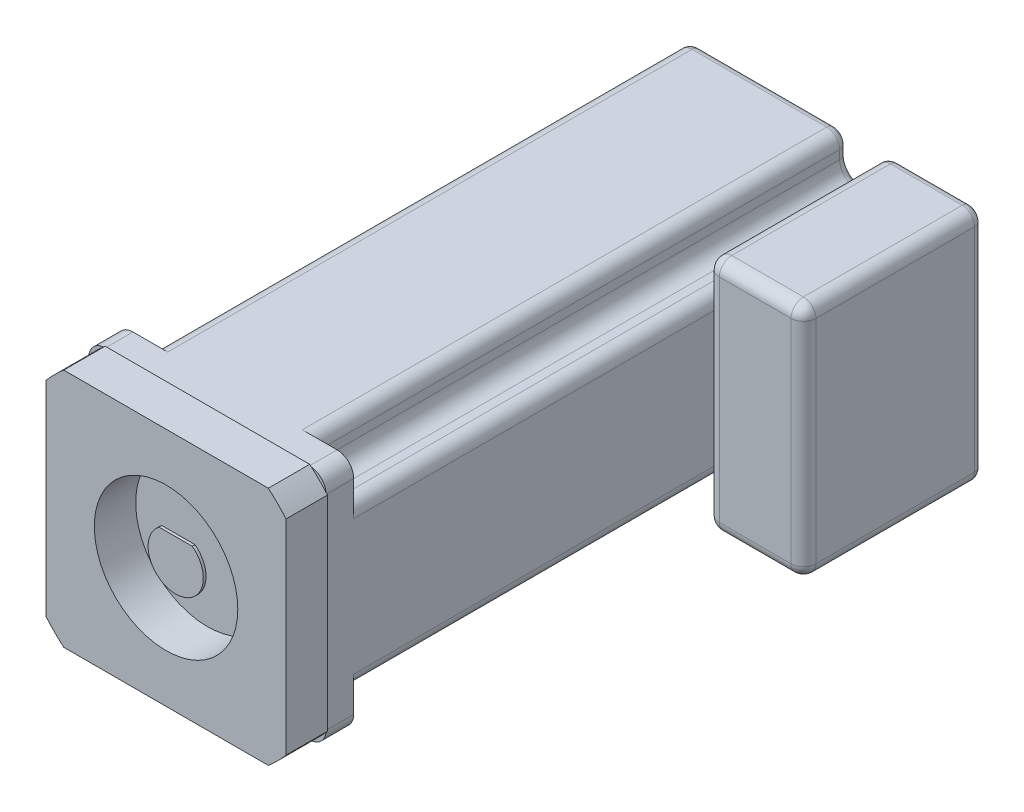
ISO-10303-21;
HEADER;
FILE_DESCRIPTION(('STEP AP214'),'2;1');
FILE_NAME('part.step','',(''),(''),'','','');
FILE_SCHEMA(('AUTOMOTIVE_DESIGN { 1 0 10303 214 1 1 1 1 }'));
ENDSEC;
DATA;
#1=APPLICATION_CONTEXT('core data for automotive mechanical design processes');
#2=APPLICATION_PROTOCOL_DEFINITION('international standard','automotive_design',2000,#1);
#3=PRODUCT_CONTEXT('',#1,'mechanical');
#4=PRODUCT('Part','Part','',(#3));
#5=PRODUCT_RELATED_PRODUCT_CATEGORY('part','',(#4));
#6=PRODUCT_DEFINITION_FORMATION('','',#4);
#7=PRODUCT_DEFINITION_CONTEXT('part definition',#1,'design');
#8=PRODUCT_DEFINITION('design','',#6,#7);
#9=PRODUCT_DEFINITION_SHAPE('','',#8);
#10=(LENGTH_UNIT() NAMED_UNIT(*) SI_UNIT(.MILLI.,.METRE.));
#11=(NAMED_UNIT(*) PLANE_ANGLE_UNIT() SI_UNIT($,.RADIAN.));
#12=(NAMED_UNIT(*) SI_UNIT($,.STERADIAN.) SOLID_ANGLE_UNIT());
#13=UNCERTAINTY_MEASURE_WITH_UNIT(LENGTH_MEASURE(1.E-05),#10,'distance_accuracy_value','');
#14=(GEOMETRIC_REPRESENTATION_CONTEXT(3) GLOBAL_UNCERTAINTY_ASSIGNED_CONTEXT((#13)) GLOBAL_UNIT_ASSIGNED_CONTEXT((#10,
#11,#12)) REPRESENTATION_CONTEXT('',''));
#15=CARTESIAN_POINT('',(0.,0.,0.));
#16=DIRECTION('',(0.,0.,1.));
#17=DIRECTION('',(1.,0.,0.));
#18=AXIS2_PLACEMENT_3D('',#15,#16,#17);
#19=CARTESIAN_POINT('',(78.,43.,-148.5));
#20=DIRECTION('',(0.,0.,-1.));
#21=DIRECTION('',(-1.,0.,0.));
#22=AXIS2_PLACEMENT_3D('',#19,#20,#21);
#23=PLANE('',#22);
#24=DIRECTION('',(0.,-1.,0.));
#25=VECTOR('',#24,1.);
#26=CARTESIAN_POINT('',(73.5,43.,-148.5));
#27=LINE('',#26,#25);
#28=CARTESIAN_POINT('',(73.5,-38.5,-148.5));
#29=VERTEX_POINT('',#28);
#30=CARTESIAN_POINT('',(73.5,38.5,-148.5));
#31=VERTEX_POINT('',#30);
#32=EDGE_CURVE('E184',#29,#31,#27,.F.);
#33=ORIENTED_EDGE('',*,*,#32,.T.);
#34=DIRECTION('',(-1.,0.,0.));
#35=VECTOR('',#34,1.);
#36=CARTESIAN_POINT('',(78.,38.5,-148.5));
#37=LINE('',#36,#35);
#38=CARTESIAN_POINT('',(47.5,38.5,-148.5));
#39=VERTEX_POINT('',#38);
#40=EDGE_CURVE('E279',#31,#39,#37,.T.);
#41=ORIENTED_EDGE('',*,*,#40,.T.);
#42=DIRECTION('',(0.,-1.,0.));
#43=VECTOR('',#42,1.);
#44=CARTESIAN_POINT('',(47.5,-43.,-148.5));
#45=LINE('',#44,#43);
#46=CARTESIAN_POINT('',(47.5,-38.5,-148.5));
#47=VERTEX_POINT('',#46);
#48=EDGE_CURVE('E291',#39,#47,#45,.T.);
#49=ORIENTED_EDGE('',*,*,#48,.T.);
#50=DIRECTION('',(-1.,0.,0.));
#51=VECTOR('',#50,1.);
#52=CARTESIAN_POINT('',(78.,-38.5,-148.5));
#53=LINE('',#52,#51);
#54=EDGE_CURVE('E284',#47,#29,#53,.F.);
#55=ORIENTED_EDGE('',*,*,#54,.T.);
#56=EDGE_LOOP('',(#33,#41,#49,#55));
#57=FACE_BOUND('',#56,.T.);
#58=ADVANCED_FACE('F52',(#57),#23,.F.);
#59=CARTESIAN_POINT('',(78.,-43.,-213.5));
#60=DIRECTION('',(0.,1.,0.));
#61=DIRECTION('',(0.,0.,1.));
#62=AXIS2_PLACEMENT_3D('',#59,#60,#61);
#63=PLANE('',#62);
#64=DIRECTION('',(0.,0.,-1.));
#65=VECTOR('',#64,1.);
#66=CARTESIAN_POINT('',(47.5,-43.,-213.5));
#67=LINE('',#66,#65);
#68=CARTESIAN_POINT('',(47.5,-43.,-153.));
#69=VERTEX_POINT('',#68);
#70=CARTESIAN_POINT('',(47.5,-43.,-210.5));
#71=VERTEX_POINT('',#70);
#72=EDGE_CURVE('E208',#69,#71,#67,.T.);
#73=ORIENTED_EDGE('',*,*,#72,.T.);
#74=DIRECTION('',(-1.,0.,0.));
#75=VECTOR('',#74,1.);
#76=CARTESIAN_POINT('',(78.,-43.,-210.5));
#77=LINE('',#76,#75);
#78=CARTESIAN_POINT('',(73.5,-43.,-210.5));
#79=VERTEX_POINT('',#78);
#80=EDGE_CURVE('E224',#71,#79,#77,.F.);
#81=ORIENTED_EDGE('',*,*,#80,.T.);
#82=DIRECTION('',(0.,0.,-1.));
#83=VECTOR('',#82,1.);
#84=CARTESIAN_POINT('',(73.5,-43.,-213.5));
#85=LINE('',#84,#83);
#86=CARTESIAN_POINT('',(73.5,-43.,-153.));
#87=VERTEX_POINT('',#86);
#88=EDGE_CURVE('E301',#79,#87,#85,.F.);
#89=ORIENTED_EDGE('',*,*,#88,.T.);
#90=DIRECTION('',(-1.,0.,0.));
#91=VECTOR('',#90,1.);
#92=CARTESIAN_POINT('',(78.,-43.,-153.));
#93=LINE('',#92,#91);
#94=EDGE_CURVE('E302',#87,#69,#93,.T.);
#95=ORIENTED_EDGE('',*,*,#94,.T.);
#96=EDGE_LOOP('',(#73,#81,#89,#95));
#97=FACE_BOUND('',#96,.T.);
#98=ADVANCED_FACE('F308',(#97),#63,.F.);
#99=CARTESIAN_POINT('',(78.,43.,-213.5));
#100=DIRECTION('',(0.,0.,1.));
#101=DIRECTION('',(1.,0.,0.));
#102=AXIS2_PLACEMENT_3D('',#99,#100,#101);
#103=PLANE('',#102);
#104=DIRECTION('',(0.,1.,0.));
#105=VECTOR('',#104,1.);
#106=CARTESIAN_POINT('',(75.,43.,-213.5));
#107=LINE('',#106,#105);
#108=CARTESIAN_POINT('',(75.,38.5,-213.5));
#109=VERTEX_POINT('',#108);
#110=CARTESIAN_POINT('',(75.,-38.5,-213.5));
#111=VERTEX_POINT('',#110);
#112=EDGE_CURVE('E205',#109,#111,#107,.F.);
#113=ORIENTED_EDGE('',*,*,#112,.T.);
#114=CARTESIAN_POINT('',(73.5,-38.5,-213.5));
#115=DIRECTION('',(0.,0.,1.));
#116=DIRECTION('',(1.,0.,0.));
#117=AXIS2_PLACEMENT_3D('',#114,#115,#116);
#118=CIRCLE('',#117,1.5);
#119=CARTESIAN_POINT('',(73.5,-40.,-213.5));
#120=VERTEX_POINT('',#119);
#121=EDGE_CURVE('E220',#111,#120,#118,.F.);
#122=ORIENTED_EDGE('',*,*,#121,.T.);
#123=DIRECTION('',(-1.,0.,0.));
#124=VECTOR('',#123,1.);
#125=CARTESIAN_POINT('',(78.,-40.,-213.5));
#126=LINE('',#125,#124);
#127=CARTESIAN_POINT('',(47.5,-40.,-213.5));
#128=VERTEX_POINT('',#127);
#129=EDGE_CURVE('E218',#120,#128,#126,.T.);
#130=ORIENTED_EDGE('',*,*,#129,.T.);
#131=CARTESIAN_POINT('',(47.5,-38.5,-213.5));
#132=DIRECTION('',(0.,0.,1.));
#133=DIRECTION('',(1.,0.,0.));
#134=AXIS2_PLACEMENT_3D('',#131,#132,#133);
#135=CIRCLE('',#134,1.5);
#136=CARTESIAN_POINT('',(46.,-38.5,-213.5));
#137=VERTEX_POINT('',#136);
#138=EDGE_CURVE('E216',#128,#137,#135,.F.);
#139=ORIENTED_EDGE('',*,*,#138,.T.);
#140=DIRECTION('',(0.,1.,0.));
#141=VECTOR('',#140,1.);
#142=CARTESIAN_POINT('',(46.,38.5,-213.5));
#143=LINE('',#142,#141);
#144=CARTESIAN_POINT('',(46.,38.5,-213.5));
#145=VERTEX_POINT('',#144);
#146=EDGE_CURVE('E214',#137,#145,#143,.T.);
#147=ORIENTED_EDGE('',*,*,#146,.T.);
#148=CARTESIAN_POINT('',(47.5,38.5,-213.5));
#149=DIRECTION('',(0.,0.,1.));
#150=DIRECTION('',(1.,0.,0.));
#151=AXIS2_PLACEMENT_3D('',#148,#149,#150);
#152=CIRCLE('',#151,1.5);
#153=CARTESIAN_POINT('',(47.5,40.,-213.5));
#154=VERTEX_POINT('',#153);
#155=EDGE_CURVE('E212',#145,#154,#152,.F.);
#156=ORIENTED_EDGE('',*,*,#155,.T.);
#157=DIRECTION('',(-1.,0.,0.));
#158=VECTOR('',#157,1.);
#159=CARTESIAN_POINT('',(78.,40.,-213.5));
#160=LINE('',#159,#158);
#161=CARTESIAN_POINT('',(73.5,40.,-213.5));
#162=VERTEX_POINT('',#161);
#163=EDGE_CURVE('E210',#154,#162,#160,.F.);
#164=ORIENTED_EDGE('',*,*,#163,.T.);
#165=CARTESIAN_POINT('',(73.5,38.5,-213.5));
#166=DIRECTION('',(0.,0.,1.));
#167=DIRECTION('',(1.,0.,0.));
#168=AXIS2_PLACEMENT_3D('',#165,#166,#167);
#169=CIRCLE('',#168,1.5);
#170=EDGE_CURVE('E207',#162,#109,#169,.F.);
#171=ORIENTED_EDGE('',*,*,#170,.T.);
#172=EDGE_LOOP('',(#113,#122,#130,#139,#147,#156,#164,#171));
#173=FACE_BOUND('',#172,.T.);
#174=ADVANCED_FACE('F375',(#173),#103,.F.);
#175=CARTESIAN_POINT('',(78.,43.,-213.5));
#176=DIRECTION('',(0.,-1.,0.));
#177=DIRECTION('',(0.,0.,-1.));
#178=AXIS2_PLACEMENT_3D('',#175,#176,#177);
#179=PLANE('',#178);
#180=DIRECTION('',(0.,0.,1.));
#181=VECTOR('',#180,1.);
#182=CARTESIAN_POINT('',(73.5,43.,-213.5));
#183=LINE('',#182,#181);
#184=CARTESIAN_POINT('',(73.5,43.,-153.));
#185=VERTEX_POINT('',#184);
#186=CARTESIAN_POINT('',(73.5,43.,-210.5));
#187=VERTEX_POINT('',#186);
#188=EDGE_CURVE('E280',#185,#187,#183,.F.);
#189=ORIENTED_EDGE('',*,*,#188,.T.);
#190=DIRECTION('',(-1.,0.,0.));
#191=VECTOR('',#190,1.);
#192=CARTESIAN_POINT('',(78.,43.,-210.5));
#193=LINE('',#192,#191);
#194=CARTESIAN_POINT('',(47.5,43.,-210.5));
#195=VERTEX_POINT('',#194);
#196=EDGE_CURVE('E232',#187,#195,#193,.T.);
#197=ORIENTED_EDGE('',*,*,#196,.T.);
#198=DIRECTION('',(0.,0.,1.));
#199=VECTOR('',#198,1.);
#200=CARTESIAN_POINT('',(47.5,43.,-148.5));
#201=LINE('',#200,#199);
#202=CARTESIAN_POINT('',(47.5,43.,-153.));
#203=VERTEX_POINT('',#202);
#204=EDGE_CURVE('E286',#195,#203,#201,.T.);
#205=ORIENTED_EDGE('',*,*,#204,.T.);
#206=DIRECTION('',(-1.,0.,0.));
#207=VECTOR('',#206,1.);
#208=CARTESIAN_POINT('',(78.,43.,-153.));
#209=LINE('',#208,#207);
#210=EDGE_CURVE('E277',#203,#185,#209,.F.);
#211=ORIENTED_EDGE('',*,*,#210,.T.);
#212=EDGE_LOOP('',(#189,#197,#205,#211));
#213=FACE_BOUND('',#212,.T.);
#214=ADVANCED_FACE('F334',(#213),#179,.F.);
#215=CARTESIAN_POINT('',(78.,0.,0.));
#216=DIRECTION('',(-1.,0.,0.));
#217=DIRECTION('',(0.,0.,1.));
#218=AXIS2_PLACEMENT_3D('',#215,#216,#217);
#219=PLANE('',#218);
#220=DIRECTION('',(0.,0.,-1.));
#221=VECTOR('',#220,1.);
#222=CARTESIAN_POINT('',(78.,-38.5,0.));
#223=LINE('',#222,#221);
#224=CARTESIAN_POINT('',(78.,-38.5,-153.));
#225=VERTEX_POINT('',#224);
#226=CARTESIAN_POINT('',(78.,-38.5,-210.5));
#227=VERTEX_POINT('',#226);
#228=EDGE_CURVE('E155',#225,#227,#223,.T.);
#229=ORIENTED_EDGE('',*,*,#228,.T.);
#230=DIRECTION('',(0.,1.,0.));
#231=VECTOR('',#230,1.);
#232=CARTESIAN_POINT('',(78.,0.,-210.5));
#233=LINE('',#232,#231);
#234=CARTESIAN_POINT('',(78.,38.5,-210.5));
#235=VERTEX_POINT('',#234);
#236=EDGE_CURVE('E13',#227,#235,#233,.T.);
#237=ORIENTED_EDGE('',*,*,#236,.T.);
#238=DIRECTION('',(0.,0.,1.));
#239=VECTOR('',#238,1.);
#240=CARTESIAN_POINT('',(78.,38.5,0.));
#241=LINE('',#240,#239);
#242=CARTESIAN_POINT('',(78.,38.5,-153.));
#243=VERTEX_POINT('',#242);
#244=EDGE_CURVE('E156',#235,#243,#241,.T.);
#245=ORIENTED_EDGE('',*,*,#244,.T.);
#246=DIRECTION('',(0.,-1.,0.));
#247=VECTOR('',#246,1.);
#248=CARTESIAN_POINT('',(78.,0.,-153.));
#249=LINE('',#248,#247);
#250=EDGE_CURVE('E152',#243,#225,#249,.T.);
#251=ORIENTED_EDGE('',*,*,#250,.T.);
#252=EDGE_LOOP('',(#229,#237,#245,#251));
#253=FACE_BOUND('',#252,.T.);
#254=ADVANCED_FACE('F154',(#253),#219,.F.);
#255=CARTESIAN_POINT('',(43.,0.,0.));
#256=DIRECTION('',(-1.,0.,0.));
#257=DIRECTION('',(0.,0.,1.));
#258=AXIS2_PLACEMENT_3D('',#255,#256,#257);
#259=PLANE('',#258);
#260=DIRECTION('',(0.,0.,1.));
#261=VECTOR('',#260,1.);
#262=CARTESIAN_POINT('',(43.,38.5,-213.5));
#263=LINE('',#262,#261);
#264=CARTESIAN_POINT('',(43.,38.5,-153.));
#265=VERTEX_POINT('',#264);
#266=CARTESIAN_POINT('',(43.,38.5,-210.5));
#267=VERTEX_POINT('',#266);
#268=EDGE_CURVE('E298',#265,#267,#263,.F.);
#269=ORIENTED_EDGE('',*,*,#268,.T.);
#270=DIRECTION('',(0.,1.,0.));
#271=VECTOR('',#270,1.);
#272=CARTESIAN_POINT('',(43.,-38.5,-210.5));
#273=LINE('',#272,#271);
#274=CARTESIAN_POINT('',(43.,-38.5,-210.5));
#275=VERTEX_POINT('',#274);
#276=EDGE_CURVE('E228',#267,#275,#273,.F.);
#277=ORIENTED_EDGE('',*,*,#276,.T.);
#278=DIRECTION('',(0.,0.,-1.));
#279=VECTOR('',#278,1.);
#280=CARTESIAN_POINT('',(43.,-38.5,-148.5));
#281=LINE('',#280,#279);
#282=CARTESIAN_POINT('',(43.,-38.5,-153.));
#283=VERTEX_POINT('',#282);
#284=EDGE_CURVE('E294',#275,#283,#281,.F.);
#285=ORIENTED_EDGE('',*,*,#284,.T.);
#286=DIRECTION('',(0.,-1.,0.));
#287=VECTOR('',#286,1.);
#288=CARTESIAN_POINT('',(43.,43.,-153.));
#289=LINE('',#288,#287);
#290=EDGE_CURVE('E296',#283,#265,#289,.F.);
#291=ORIENTED_EDGE('',*,*,#290,.T.);
#292=EDGE_LOOP('',(#269,#277,#285,#291));
#293=FACE_BOUND('',#292,.T.);
#294=ADVANCED_FACE('F347',(#293),#259,.T.);
#295=CARTESIAN_POINT('',(47.5,-38.5,-213.5));
#296=DIRECTION('',(0.,0.,1.));
#297=DIRECTION('',(1.,0.,0.));
#298=AXIS2_PLACEMENT_3D('',#295,#296,#297);
#299=CYLINDRICAL_SURFACE('',#298,4.5);
#300=ORIENTED_EDGE('',*,*,#284,.F.);
#301=CARTESIAN_POINT('',(47.5,-38.5,-210.5));
#302=DIRECTION('',(0.,0.,1.));
#303=DIRECTION('',(1.,0.,0.));
#304=AXIS2_PLACEMENT_3D('',#301,#302,#303);
#305=CIRCLE('',#304,4.5);
#306=EDGE_CURVE('E226',#275,#71,#305,.T.);
#307=ORIENTED_EDGE('',*,*,#306,.T.);
#308=ORIENTED_EDGE('',*,*,#72,.F.);
#309=CARTESIAN_POINT('',(47.5,-38.5,-153.));
#310=DIRECTION('',(0.,0.,1.));
#311=DIRECTION('',(1.,0.,0.));
#312=AXIS2_PLACEMENT_3D('',#309,#310,#311);
#313=CIRCLE('',#312,4.5);
#314=EDGE_CURVE('E172',#283,#69,#313,.T.);
#315=ORIENTED_EDGE('',*,*,#314,.F.);
#316=EDGE_LOOP('',(#300,#307,#308,#315));
#317=FACE_BOUND('',#316,.T.);
#318=ADVANCED_FACE('F348',(#317),#299,.T.);
#319=CARTESIAN_POINT('',(47.5,-38.5,-153.));
#320=DIRECTION('',(0.,0.,1.));
#321=DIRECTION('',(1.,0.,0.));
#322=AXIS2_PLACEMENT_3D('',#319,#320,#321);
#323=SPHERICAL_SURFACE('',#322,4.5);
#324=CARTESIAN_POINT('',(47.5,-38.5,-153.));
#325=DIRECTION('',(0.,-1.,0.));
#326=DIRECTION('',(0.,0.,-1.));
#327=AXIS2_PLACEMENT_3D('',#324,#325,#326);
#328=CIRCLE('',#327,4.5);
#329=EDGE_CURVE('E181',#283,#47,#328,.F.);
#330=ORIENTED_EDGE('',*,*,#329,.F.);
#331=ORIENTED_EDGE('',*,*,#314,.T.);
#332=CARTESIAN_POINT('',(47.5,-38.5,-153.));
#333=DIRECTION('',(-1.,0.,0.));
#334=DIRECTION('',(0.,0.,1.));
#335=AXIS2_PLACEMENT_3D('',#332,#333,#334);
#336=CIRCLE('',#335,4.5);
#337=EDGE_CURVE('E200',#47,#69,#336,.F.);
#338=ORIENTED_EDGE('',*,*,#337,.F.);
#339=EDGE_LOOP('',(#330,#331,#338));
#340=FACE_BOUND('',#339,.T.);
#341=ADVANCED_FACE('F353',(#340),#323,.T.);
#342=CARTESIAN_POINT('',(73.5,-38.5,0.));
#343=DIRECTION('',(0.,0.,-1.));
#344=DIRECTION('',(-1.,0.,0.));
#345=AXIS2_PLACEMENT_3D('',#342,#343,#344);
#346=CYLINDRICAL_SURFACE('',#345,4.5);
#347=ORIENTED_EDGE('',*,*,#88,.F.);
#348=CARTESIAN_POINT('',(73.5,-38.5,-210.5));
#349=DIRECTION('',(0.,0.,1.));
#350=DIRECTION('',(1.,0.,0.));
#351=AXIS2_PLACEMENT_3D('',#348,#349,#350);
#352=CIRCLE('',#351,4.5);
#353=EDGE_CURVE('E171',#79,#227,#352,.T.);
#354=ORIENTED_EDGE('',*,*,#353,.T.);
#355=ORIENTED_EDGE('',*,*,#228,.F.);
#356=CARTESIAN_POINT('',(73.5,-38.5,-153.));
#357=DIRECTION('',(0.,0.,1.));
#358=DIRECTION('',(1.,0.,0.));
#359=AXIS2_PLACEMENT_3D('',#356,#357,#358);
#360=CIRCLE('',#359,4.5);
#361=EDGE_CURVE('E168',#87,#225,#360,.T.);
#362=ORIENTED_EDGE('',*,*,#361,.F.);
#363=EDGE_LOOP('',(#347,#354,#355,#362));
#364=FACE_BOUND('',#363,.T.);
#365=ADVANCED_FACE('F167',(#364),#346,.T.);
#366=CARTESIAN_POINT('',(78.,-38.5,-153.));
#367=DIRECTION('',(-1.,0.,0.));
#368=DIRECTION('',(0.,0.,1.));
#369=AXIS2_PLACEMENT_3D('',#366,#367,#368);
#370=CYLINDRICAL_SURFACE('',#369,4.5);
#371=ORIENTED_EDGE('',*,*,#337,.T.);
#372=ORIENTED_EDGE('',*,*,#94,.F.);
#373=CARTESIAN_POINT('',(73.5,-38.5,-153.));
#374=DIRECTION('',(1.,0.,0.));
#375=DIRECTION('',(0.,0.,-1.));
#376=AXIS2_PLACEMENT_3D('',#373,#374,#375);
#377=CIRCLE('',#376,4.5);
#378=EDGE_CURVE('E180',#29,#87,#377,.T.);
#379=ORIENTED_EDGE('',*,*,#378,.F.);
#380=ORIENTED_EDGE('',*,*,#54,.F.);
#381=EDGE_LOOP('',(#371,#372,#379,#380));
#382=FACE_BOUND('',#381,.T.);
#383=ADVANCED_FACE('F502',(#382),#370,.T.);
#384=CARTESIAN_POINT('',(47.5,43.,-153.));
#385=DIRECTION('',(0.,1.,0.));
#386=DIRECTION('',(0.,0.,1.));
#387=AXIS2_PLACEMENT_3D('',#384,#385,#386);
#388=CYLINDRICAL_SURFACE('',#387,4.5);
#389=ORIENTED_EDGE('',*,*,#329,.T.);
#390=ORIENTED_EDGE('',*,*,#48,.F.);
#391=CARTESIAN_POINT('',(47.5,38.5,-153.));
#392=DIRECTION('',(0.,1.,0.));
#393=DIRECTION('',(0.,0.,1.));
#394=AXIS2_PLACEMENT_3D('',#391,#392,#393);
#395=CIRCLE('',#394,4.5);
#396=EDGE_CURVE('E189',#265,#39,#395,.T.);
#397=ORIENTED_EDGE('',*,*,#396,.F.);
#398=ORIENTED_EDGE('',*,*,#290,.F.);
#399=EDGE_LOOP('',(#389,#390,#397,#398));
#400=FACE_BOUND('',#399,.T.);
#401=ADVANCED_FACE('F358',(#400),#388,.T.);
#402=CARTESIAN_POINT('',(47.5,38.5,-213.5));
#403=DIRECTION('',(0.,0.,-1.));
#404=DIRECTION('',(-1.,0.,0.));
#405=AXIS2_PLACEMENT_3D('',#402,#403,#404);
#406=CYLINDRICAL_SURFACE('',#405,4.5);
#407=ORIENTED_EDGE('',*,*,#204,.F.);
#408=CARTESIAN_POINT('',(47.5,38.5,-210.5));
#409=DIRECTION('',(0.,0.,1.));
#410=DIRECTION('',(1.,0.,0.));
#411=AXIS2_PLACEMENT_3D('',#408,#409,#410);
#412=CIRCLE('',#411,4.5);
#413=EDGE_CURVE('E230',#195,#267,#412,.T.);
#414=ORIENTED_EDGE('',*,*,#413,.T.);
#415=ORIENTED_EDGE('',*,*,#268,.F.);
#416=CARTESIAN_POINT('',(47.5,38.5,-153.));
#417=DIRECTION('',(0.,0.,1.));
#418=DIRECTION('',(1.,0.,0.));
#419=AXIS2_PLACEMENT_3D('',#416,#417,#418);
#420=CIRCLE('',#419,4.5);
#421=EDGE_CURVE('E185',#203,#265,#420,.T.);
#422=ORIENTED_EDGE('',*,*,#421,.F.);
#423=EDGE_LOOP('',(#407,#414,#415,#422));
#424=FACE_BOUND('',#423,.T.);
#425=ADVANCED_FACE('F338',(#424),#406,.T.);
#426=CARTESIAN_POINT('',(73.5,-38.5,-153.));
#427=DIRECTION('',(0.,0.,1.));
#428=DIRECTION('',(1.,0.,0.));
#429=AXIS2_PLACEMENT_3D('',#426,#427,#428);
#430=SPHERICAL_SURFACE('',#429,4.5);
#431=ORIENTED_EDGE('',*,*,#378,.T.);
#432=ORIENTED_EDGE('',*,*,#361,.T.);
#433=CARTESIAN_POINT('',(73.5,-38.5,-153.));
#434=DIRECTION('',(0.,-1.,0.));
#435=DIRECTION('',(0.,0.,-1.));
#436=AXIS2_PLACEMENT_3D('',#433,#434,#435);
#437=CIRCLE('',#436,4.5);
#438=EDGE_CURVE('E177',#29,#225,#437,.F.);
#439=ORIENTED_EDGE('',*,*,#438,.F.);
#440=EDGE_LOOP('',(#431,#432,#439));
#441=FACE_BOUND('',#440,.T.);
#442=ADVANCED_FACE('F176',(#441),#430,.T.);
#443=CARTESIAN_POINT('',(47.5,38.5,-153.));
#444=DIRECTION('',(0.,0.,1.));
#445=DIRECTION('',(1.,0.,0.));
#446=AXIS2_PLACEMENT_3D('',#443,#444,#445);
#447=SPHERICAL_SURFACE('',#446,4.5);
#448=ORIENTED_EDGE('',*,*,#421,.T.);
#449=ORIENTED_EDGE('',*,*,#396,.T.);
#450=CARTESIAN_POINT('',(47.5,38.5,-153.));
#451=DIRECTION('',(-1.,0.,0.));
#452=DIRECTION('',(0.,0.,1.));
#453=AXIS2_PLACEMENT_3D('',#450,#451,#452);
#454=CIRCLE('',#453,4.5);
#455=EDGE_CURVE('E186',#203,#39,#454,.F.);
#456=ORIENTED_EDGE('',*,*,#455,.F.);
#457=EDGE_LOOP('',(#448,#449,#456));
#458=FACE_BOUND('',#457,.T.);
#459=ADVANCED_FACE('F360',(#458),#447,.T.);
#460=CARTESIAN_POINT('',(73.5,0.,-153.));
#461=DIRECTION('',(0.,-1.,0.));
#462=DIRECTION('',(0.,0.,-1.));
#463=AXIS2_PLACEMENT_3D('',#460,#461,#462);
#464=CYLINDRICAL_SURFACE('',#463,4.5);
#465=ORIENTED_EDGE('',*,*,#438,.T.);
#466=ORIENTED_EDGE('',*,*,#250,.F.);
#467=CARTESIAN_POINT('',(73.5,38.5,-153.));
#468=DIRECTION('',(0.,1.,0.));
#469=DIRECTION('',(0.,0.,1.));
#470=AXIS2_PLACEMENT_3D('',#467,#468,#469);
#471=CIRCLE('',#470,4.5);
#472=EDGE_CURVE('E191',#31,#243,#471,.T.);
#473=ORIENTED_EDGE('',*,*,#472,.F.);
#474=ORIENTED_EDGE('',*,*,#32,.F.);
#475=EDGE_LOOP('',(#465,#466,#473,#474));
#476=FACE_BOUND('',#475,.T.);
#477=ADVANCED_FACE('F183',(#476),#464,.T.);
#478=CARTESIAN_POINT('',(78.,38.5,-153.));
#479=DIRECTION('',(-1.,0.,0.));
#480=DIRECTION('',(0.,0.,1.));
#481=AXIS2_PLACEMENT_3D('',#478,#479,#480);
#482=CYLINDRICAL_SURFACE('',#481,4.5);
#483=ORIENTED_EDGE('',*,*,#455,.T.);
#484=ORIENTED_EDGE('',*,*,#40,.F.);
#485=CARTESIAN_POINT('',(73.5,38.5,-153.));
#486=DIRECTION('',(1.,0.,0.));
#487=DIRECTION('',(0.,0.,-1.));
#488=AXIS2_PLACEMENT_3D('',#485,#486,#487);
#489=CIRCLE('',#488,4.5);
#490=EDGE_CURVE('E262',#185,#31,#489,.T.);
#491=ORIENTED_EDGE('',*,*,#490,.F.);
#492=ORIENTED_EDGE('',*,*,#210,.F.);
#493=EDGE_LOOP('',(#483,#484,#491,#492));
#494=FACE_BOUND('',#493,.T.);
#495=ADVANCED_FACE('F276',(#494),#482,.T.);
#496=CARTESIAN_POINT('',(73.5,38.5,-153.));
#497=DIRECTION('',(0.,0.,1.));
#498=DIRECTION('',(1.,0.,0.));
#499=AXIS2_PLACEMENT_3D('',#496,#497,#498);
#500=SPHERICAL_SURFACE('',#499,4.5);
#501=ORIENTED_EDGE('',*,*,#490,.T.);
#502=ORIENTED_EDGE('',*,*,#472,.T.);
#503=CARTESIAN_POINT('',(73.5,38.5,-153.));
#504=DIRECTION('',(0.,0.,1.));
#505=DIRECTION('',(1.,0.,0.));
#506=AXIS2_PLACEMENT_3D('',#503,#504,#505);
#507=CIRCLE('',#506,4.5);
#508=EDGE_CURVE('E257',#185,#243,#507,.F.);
#509=ORIENTED_EDGE('',*,*,#508,.F.);
#510=EDGE_LOOP('',(#501,#502,#509));
#511=FACE_BOUND('',#510,.T.);
#512=ADVANCED_FACE('F271',(#511),#500,.T.);
#513=CARTESIAN_POINT('',(73.5,38.5,0.));
#514=DIRECTION('',(0.,0.,1.));
#515=DIRECTION('',(1.,0.,0.));
#516=AXIS2_PLACEMENT_3D('',#513,#514,#515);
#517=CYLINDRICAL_SURFACE('',#516,4.5);
#518=ORIENTED_EDGE('',*,*,#244,.F.);
#519=CARTESIAN_POINT('',(73.5,38.5,-210.5));
#520=DIRECTION('',(0.,0.,1.));
#521=DIRECTION('',(1.,0.,0.));
#522=AXIS2_PLACEMENT_3D('',#519,#520,#521);
#523=CIRCLE('',#522,4.5);
#524=EDGE_CURVE('E61',#235,#187,#523,.T.);
#525=ORIENTED_EDGE('',*,*,#524,.T.);
#526=ORIENTED_EDGE('',*,*,#188,.F.);
#527=ORIENTED_EDGE('',*,*,#508,.T.);
#528=EDGE_LOOP('',(#518,#525,#526,#527));
#529=FACE_BOUND('',#528,.T.);
#530=ADVANCED_FACE('F281',(#529),#517,.T.);
#531=CARTESIAN_POINT('',(47.5,38.5,-210.5));
#532=DIRECTION('',(0.,0.,1.));
#533=DIRECTION('',(1.,0.,0.));
#534=AXIS2_PLACEMENT_3D('',#531,#532,#533);
#535=DEGENERATE_TOROIDAL_SURFACE('',#534,1.5,3.,.T.);
#536=CARTESIAN_POINT('',(46.,38.5,-210.5));
#537=DIRECTION('',(0.,-1.,0.));
#538=DIRECTION('',(0.,0.,-1.));
#539=AXIS2_PLACEMENT_3D('',#536,#537,#538);
#540=CIRCLE('',#539,3.);
#541=EDGE_CURVE('E250',#267,#145,#540,.T.);
#542=ORIENTED_EDGE('',*,*,#541,.F.);
#543=ORIENTED_EDGE('',*,*,#413,.F.);
#544=CARTESIAN_POINT('',(47.5,40.,-210.5));
#545=DIRECTION('',(1.,0.,0.));
#546=DIRECTION('',(0.,0.,-1.));
#547=AXIS2_PLACEMENT_3D('',#544,#545,#546);
#548=CIRCLE('',#547,3.);
#549=EDGE_CURVE('E56',#154,#195,#548,.T.);
#550=ORIENTED_EDGE('',*,*,#549,.F.);
#551=ORIENTED_EDGE('',*,*,#155,.F.);
#552=EDGE_LOOP('',(#542,#543,#550,#551));
#553=FACE_BOUND('',#552,.T.);
#554=ADVANCED_FACE('F54',(#553),#535,.T.);
#555=CARTESIAN_POINT('',(78.,40.,-210.5));
#556=DIRECTION('',(-1.,0.,0.));
#557=DIRECTION('',(0.,0.,1.));
#558=AXIS2_PLACEMENT_3D('',#555,#556,#557);
#559=CYLINDRICAL_SURFACE('',#558,3.);
#560=ORIENTED_EDGE('',*,*,#549,.T.);
#561=ORIENTED_EDGE('',*,*,#196,.F.);
#562=CARTESIAN_POINT('',(73.5,40.,-210.5));
#563=DIRECTION('',(1.,0.,0.));
#564=DIRECTION('',(0.,0.,-1.));
#565=AXIS2_PLACEMENT_3D('',#562,#563,#564);
#566=CIRCLE('',#565,3.);
#567=EDGE_CURVE('E248',#162,#187,#566,.T.);
#568=ORIENTED_EDGE('',*,*,#567,.F.);
#569=ORIENTED_EDGE('',*,*,#163,.F.);
#570=EDGE_LOOP('',(#560,#561,#568,#569));
#571=FACE_BOUND('',#570,.T.);
#572=ADVANCED_FACE('F332',(#571),#559,.T.);
#573=CARTESIAN_POINT('',(46.,43.,-210.5));
#574=DIRECTION('',(0.,-1.,0.));
#575=DIRECTION('',(0.,0.,-1.));
#576=AXIS2_PLACEMENT_3D('',#573,#574,#575);
#577=CYLINDRICAL_SURFACE('',#576,3.);
#578=ORIENTED_EDGE('',*,*,#541,.T.);
#579=ORIENTED_EDGE('',*,*,#146,.F.);
#580=CARTESIAN_POINT('',(46.,-38.5,-210.5));
#581=DIRECTION('',(0.,-1.,0.));
#582=DIRECTION('',(0.,0.,-1.));
#583=AXIS2_PLACEMENT_3D('',#580,#581,#582);
#584=CIRCLE('',#583,3.);
#585=EDGE_CURVE('E245',#275,#137,#584,.T.);
#586=ORIENTED_EDGE('',*,*,#585,.F.);
#587=ORIENTED_EDGE('',*,*,#276,.F.);
#588=EDGE_LOOP('',(#578,#579,#586,#587));
#589=FACE_BOUND('',#588,.T.);
#590=ADVANCED_FACE('F344',(#589),#577,.T.);
#591=CARTESIAN_POINT('',(73.5,38.5,-210.5));
#592=DIRECTION('',(0.,0.,1.));
#593=DIRECTION('',(1.,0.,0.));
#594=AXIS2_PLACEMENT_3D('',#591,#592,#593);
#595=DEGENERATE_TOROIDAL_SURFACE('',#594,1.5,3.,.T.);
#596=ORIENTED_EDGE('',*,*,#567,.T.);
#597=ORIENTED_EDGE('',*,*,#524,.F.);
#598=CARTESIAN_POINT('',(75.,38.5,-210.5));
#599=DIRECTION('',(0.,-1.,0.));
#600=DIRECTION('',(0.,0.,-1.));
#601=AXIS2_PLACEMENT_3D('',#598,#599,#600);
#602=CIRCLE('',#601,3.);
#603=EDGE_CURVE('E242',#109,#235,#602,.T.);
#604=ORIENTED_EDGE('',*,*,#603,.F.);
#605=ORIENTED_EDGE('',*,*,#170,.F.);
#606=EDGE_LOOP('',(#596,#597,#604,#605));
#607=FACE_BOUND('',#606,.T.);
#608=ADVANCED_FACE('F330',(#607),#595,.T.);
#609=CARTESIAN_POINT('',(47.5,-38.5,-210.5));
#610=DIRECTION('',(0.,0.,1.));
#611=DIRECTION('',(1.,0.,0.));
#612=AXIS2_PLACEMENT_3D('',#609,#610,#611);
#613=DEGENERATE_TOROIDAL_SURFACE('',#612,1.5,3.,.T.);
#614=ORIENTED_EDGE('',*,*,#585,.T.);
#615=ORIENTED_EDGE('',*,*,#138,.F.);
#616=CARTESIAN_POINT('',(47.5,-40.,-210.5));
#617=DIRECTION('',(1.,0.,0.));
#618=DIRECTION('',(0.,0.,-1.));
#619=AXIS2_PLACEMENT_3D('',#616,#617,#618);
#620=CIRCLE('',#619,3.);
#621=EDGE_CURVE('E239',#71,#128,#620,.T.);
#622=ORIENTED_EDGE('',*,*,#621,.F.);
#623=ORIENTED_EDGE('',*,*,#306,.F.);
#624=EDGE_LOOP('',(#614,#615,#622,#623));
#625=FACE_BOUND('',#624,.T.);
#626=ADVANCED_FACE('F315',(#625),#613,.T.);
#627=CARTESIAN_POINT('',(75.,0.,-210.5));
#628=DIRECTION('',(0.,1.,0.));
#629=DIRECTION('',(0.,0.,1.));
#630=AXIS2_PLACEMENT_3D('',#627,#628,#629);
#631=CYLINDRICAL_SURFACE('',#630,3.);
#632=ORIENTED_EDGE('',*,*,#603,.T.);
#633=ORIENTED_EDGE('',*,*,#236,.F.);
#634=CARTESIAN_POINT('',(75.,-38.5,-210.5));
#635=DIRECTION('',(0.,-1.,0.));
#636=DIRECTION('',(0.,0.,-1.));
#637=AXIS2_PLACEMENT_3D('',#634,#635,#636);
#638=CIRCLE('',#637,3.);
#639=EDGE_CURVE('E237',#111,#227,#638,.T.);
#640=ORIENTED_EDGE('',*,*,#639,.F.);
#641=ORIENTED_EDGE('',*,*,#112,.F.);
#642=EDGE_LOOP('',(#632,#633,#640,#641));
#643=FACE_BOUND('',#642,.T.);
#644=ADVANCED_FACE('F326',(#643),#631,.T.);
#645=CARTESIAN_POINT('',(78.,-40.,-210.5));
#646=DIRECTION('',(-1.,0.,0.));
#647=DIRECTION('',(0.,0.,1.));
#648=AXIS2_PLACEMENT_3D('',#645,#646,#647);
#649=CYLINDRICAL_SURFACE('',#648,3.);
#650=ORIENTED_EDGE('',*,*,#621,.T.);
#651=ORIENTED_EDGE('',*,*,#129,.F.);
#652=CARTESIAN_POINT('',(73.5,-40.,-210.5));
#653=DIRECTION('',(1.,0.,0.));
#654=DIRECTION('',(0.,0.,-1.));
#655=AXIS2_PLACEMENT_3D('',#652,#653,#654);
#656=CIRCLE('',#655,3.);
#657=EDGE_CURVE('E235',#79,#120,#656,.T.);
#658=ORIENTED_EDGE('',*,*,#657,.F.);
#659=ORIENTED_EDGE('',*,*,#80,.F.);
#660=EDGE_LOOP('',(#650,#651,#658,#659));
#661=FACE_BOUND('',#660,.T.);
#662=ADVANCED_FACE('F319',(#661),#649,.T.);
#663=CARTESIAN_POINT('',(73.5,-38.5,-210.5));
#664=DIRECTION('',(0.,0.,1.));
#665=DIRECTION('',(1.,0.,0.));
#666=AXIS2_PLACEMENT_3D('',#663,#664,#665);
#667=DEGENERATE_TOROIDAL_SURFACE('',#666,1.5,3.,.T.);
#668=ORIENTED_EDGE('',*,*,#639,.T.);
#669=ORIENTED_EDGE('',*,*,#353,.F.);
#670=ORIENTED_EDGE('',*,*,#657,.T.);
#671=ORIENTED_EDGE('',*,*,#121,.F.);
#672=EDGE_LOOP('',(#668,#669,#670,#671));
#673=FACE_BOUND('',#672,.T.);
#674=ADVANCED_FACE('F322',(#673),#667,.T.);
#675=CLOSED_SHELL('',(#58,#98,#174,#214,#254,#294,#318,#341,#365,#383,#401,#425,#442,#459,#477,
#495,#512,#530,#554,#572,#590,#608,#626,#644,#662,#674));
#676=MANIFOLD_SOLID_BREP('B2',#675);
#677=CARTESIAN_POINT('',(43.,43.,-213.5));
#678=DIRECTION('',(-1.,0.,0.));
#679=DIRECTION('',(0.,0.,1.));
#680=AXIS2_PLACEMENT_3D('',#677,#678,#679);
#681=PLANE('',#680);
#682=DIRECTION('',(0.,0.,-1.));
#683=VECTOR('',#682,1.);
#684=CARTESIAN_POINT('',(43.,-24.4,-213.5));
#685=LINE('',#684,#683);
#686=CARTESIAN_POINT('',(43.,-24.4,-20.5));
#687=VERTEX_POINT('',#686);
#688=CARTESIAN_POINT('',(43.,-24.4,-210.5));
#689=VERTEX_POINT('',#688);
#690=EDGE_CURVE('E979',#687,#689,#685,.T.);
#691=ORIENTED_EDGE('',*,*,#690,.T.);
#692=DIRECTION('',(0.,-1.,0.));
#693=VECTOR('',#692,1.);
#694=CARTESIAN_POINT('',(43.,43.,-210.5));
#695=LINE('',#694,#693);
#696=CARTESIAN_POINT('',(43.,24.4,-210.5));
#697=VERTEX_POINT('',#696);
#698=EDGE_CURVE('E50',#689,#697,#695,.F.);
#699=ORIENTED_EDGE('',*,*,#698,.T.);
#700=DIRECTION('',(0.,0.,-1.));
#701=VECTOR('',#700,1.);
#702=CARTESIAN_POINT('',(43.,24.4,-213.5));
#703=LINE('',#702,#701);
#704=CARTESIAN_POINT('',(43.,24.4,-20.5));
#705=VERTEX_POINT('',#704);
#706=EDGE_CURVE('E977',#697,#705,#703,.F.);
#707=ORIENTED_EDGE('',*,*,#706,.T.);
#708=DIRECTION('',(0.,-1.,0.));
#709=VECTOR('',#708,1.);
#710=CARTESIAN_POINT('',(43.,43.,-20.5));
#711=LINE('',#710,#709);
#712=CARTESIAN_POINT('',(43.,37.,-20.5));
#713=VERTEX_POINT('',#712);
#714=EDGE_CURVE('E1230',#713,#705,#711,.T.);
#715=ORIENTED_EDGE('',*,*,#714,.F.);
#716=DIRECTION('',(0.,0.,1.));
#717=VECTOR('',#716,1.);
#718=CARTESIAN_POINT('',(43.,37.,-213.5));
#719=LINE('',#718,#717);
#720=CARTESIAN_POINT('',(43.,37.,-10.5));
#721=VERTEX_POINT('',#720);
#722=EDGE_CURVE('E959',#713,#721,#719,.T.);
#723=ORIENTED_EDGE('',*,*,#722,.T.);
#724=DIRECTION('',(0.,-1.,0.));
#725=VECTOR('',#724,1.);
#726=CARTESIAN_POINT('',(43.,43.,-10.5));
#727=LINE('',#726,#725);
#728=CARTESIAN_POINT('',(43.,-37.,-10.5));
#729=VERTEX_POINT('',#728);
#730=EDGE_CURVE('E1233',#721,#729,#727,.T.);
#731=ORIENTED_EDGE('',*,*,#730,.T.);
#732=DIRECTION('',(0.,0.,1.));
#733=VECTOR('',#732,1.);
#734=CARTESIAN_POINT('',(43.,-37.,-213.5));
#735=LINE('',#734,#733);
#736=CARTESIAN_POINT('',(43.,-37.,-20.5));
#737=VERTEX_POINT('',#736);
#738=EDGE_CURVE('E962',#729,#737,#735,.F.);
#739=ORIENTED_EDGE('',*,*,#738,.T.);
#740=DIRECTION('',(0.,-1.,0.));
#741=VECTOR('',#740,1.);
#742=CARTESIAN_POINT('',(43.,-43.,-20.5));
#743=LINE('',#742,#741);
#744=EDGE_CURVE('E1204',#687,#737,#743,.T.);
#745=ORIENTED_EDGE('',*,*,#744,.F.);
#746=EDGE_LOOP('',(#691,#699,#707,#715,#723,#731,#739,#745));
#747=FACE_BOUND('',#746,.T.);
#748=ADVANCED_FACE('F595',(#747),#681,.F.);
#749=CARTESIAN_POINT('',(-43.,-43.,-213.5));
#750=DIRECTION('',(0.,1.,0.));
#751=DIRECTION('',(0.,0.,1.));
#752=AXIS2_PLACEMENT_3D('',#749,#750,#751);
#753=PLANE('',#752);
#754=DIRECTION('',(0.,0.,-1.));
#755=VECTOR('',#754,1.);
#756=CARTESIAN_POINT('',(-24.4,-43.,-213.5));
#757=LINE('',#756,#755);
#758=CARTESIAN_POINT('',(-24.4,-43.,-20.5));
#759=VERTEX_POINT('',#758);
#760=CARTESIAN_POINT('',(-24.4,-43.,-210.5));
#761=VERTEX_POINT('',#760);
#762=EDGE_CURVE('E972',#759,#761,#757,.T.);
#763=ORIENTED_EDGE('',*,*,#762,.T.);
#764=DIRECTION('',(-1.,0.,0.));
#765=VECTOR('',#764,1.);
#766=CARTESIAN_POINT('',(-43.,-43.,-210.5));
#767=LINE('',#766,#765);
#768=CARTESIAN_POINT('',(24.4,-43.,-210.5));
#769=VERTEX_POINT('',#768);
#770=EDGE_CURVE('E1109',#761,#769,#767,.F.);
#771=ORIENTED_EDGE('',*,*,#770,.T.);
#772=DIRECTION('',(0.,0.,-1.));
#773=VECTOR('',#772,1.);
#774=CARTESIAN_POINT('',(24.4,-43.,-213.5));
#775=LINE('',#774,#773);
#776=CARTESIAN_POINT('',(24.4,-43.,-20.5));
#777=VERTEX_POINT('',#776);
#778=EDGE_CURVE('E975',#769,#777,#775,.F.);
#779=ORIENTED_EDGE('',*,*,#778,.T.);
#780=DIRECTION('',(-1.,0.,0.));
#781=VECTOR('',#780,1.);
#782=CARTESIAN_POINT('',(43.,-43.,-20.5));
#783=LINE('',#782,#781);
#784=CARTESIAN_POINT('',(37.,-43.,-20.5));
#785=VERTEX_POINT('',#784);
#786=EDGE_CURVE('E1189',#785,#777,#783,.T.);
#787=ORIENTED_EDGE('',*,*,#786,.F.);
#788=DIRECTION('',(0.,0.,1.));
#789=VECTOR('',#788,1.);
#790=CARTESIAN_POINT('',(37.,-43.,-213.5));
#791=LINE('',#790,#789);
#792=CARTESIAN_POINT('',(37.,-43.,-10.5));
#793=VERTEX_POINT('',#792);
#794=EDGE_CURVE('E954',#785,#793,#791,.T.);
#795=ORIENTED_EDGE('',*,*,#794,.T.);
#796=DIRECTION('',(-1.,0.,0.));
#797=VECTOR('',#796,1.);
#798=CARTESIAN_POINT('',(-43.,-43.,-10.5));
#799=LINE('',#798,#797);
#800=CARTESIAN_POINT('',(-37.,-43.,-10.5));
#801=VERTEX_POINT('',#800);
#802=EDGE_CURVE('E1241',#793,#801,#799,.T.);
#803=ORIENTED_EDGE('',*,*,#802,.T.);
#804=DIRECTION('',(0.,0.,1.));
#805=VECTOR('',#804,1.);
#806=CARTESIAN_POINT('',(-37.,-43.,-213.5));
#807=LINE('',#806,#805);
#808=CARTESIAN_POINT('',(-37.,-43.,-20.5));
#809=VERTEX_POINT('',#808);
#810=EDGE_CURVE('E957',#801,#809,#807,.F.);
#811=ORIENTED_EDGE('',*,*,#810,.T.);
#812=DIRECTION('',(-1.,0.,0.));
#813=VECTOR('',#812,1.);
#814=CARTESIAN_POINT('',(-43.,-43.,-20.5));
#815=LINE('',#814,#813);
#816=EDGE_CURVE('E1217',#759,#809,#815,.T.);
#817=ORIENTED_EDGE('',*,*,#816,.F.);
#818=EDGE_LOOP('',(#763,#771,#779,#787,#795,#803,#811,#817));
#819=FACE_BOUND('',#818,.T.);
#820=ADVANCED_FACE('F1351',(#819),#753,.F.);
#821=CARTESIAN_POINT('',(-43.,43.,-213.5));
#822=DIRECTION('',(1.,0.,0.));
#823=DIRECTION('',(0.,0.,-1.));
#824=AXIS2_PLACEMENT_3D('',#821,#822,#823);
#825=PLANE('',#824);
#826=DIRECTION('',(0.,0.,-1.));
#827=VECTOR('',#826,1.);
#828=CARTESIAN_POINT('',(-43.,24.4,-213.5));
#829=LINE('',#828,#827);
#830=CARTESIAN_POINT('',(-43.,24.4,-20.5));
#831=VERTEX_POINT('',#830);
#832=CARTESIAN_POINT('',(-43.,24.4,-210.5));
#833=VERTEX_POINT('',#832);
#834=EDGE_CURVE('E998',#831,#833,#829,.T.);
#835=ORIENTED_EDGE('',*,*,#834,.T.);
#836=DIRECTION('',(0.,1.,0.));
#837=VECTOR('',#836,1.);
#838=CARTESIAN_POINT('',(-43.,43.,-210.5));
#839=LINE('',#838,#837);
#840=CARTESIAN_POINT('',(-43.,-24.4,-210.5));
#841=VERTEX_POINT('',#840);
#842=EDGE_CURVE('E1097',#833,#841,#839,.F.);
#843=ORIENTED_EDGE('',*,*,#842,.T.);
#844=DIRECTION('',(0.,0.,-1.));
#845=VECTOR('',#844,1.);
#846=CARTESIAN_POINT('',(-43.,-24.4,-213.5));
#847=LINE('',#846,#845);
#848=CARTESIAN_POINT('',(-43.,-24.4,-20.5));
#849=VERTEX_POINT('',#848);
#850=EDGE_CURVE('E996',#841,#849,#847,.F.);
#851=ORIENTED_EDGE('',*,*,#850,.T.);
#852=DIRECTION('',(0.,1.,0.));
#853=VECTOR('',#852,1.);
#854=CARTESIAN_POINT('',(-43.,-43.,-20.5));
#855=LINE('',#854,#853);
#856=CARTESIAN_POINT('',(-43.,-37.,-20.5));
#857=VERTEX_POINT('',#856);
#858=EDGE_CURVE('E1213',#857,#849,#855,.T.);
#859=ORIENTED_EDGE('',*,*,#858,.F.);
#860=DIRECTION('',(0.,0.,1.));
#861=VECTOR('',#860,1.);
#862=CARTESIAN_POINT('',(-43.,-37.,-213.5));
#863=LINE('',#862,#861);
#864=CARTESIAN_POINT('',(-43.,-37.,-10.5));
#865=VERTEX_POINT('',#864);
#866=EDGE_CURVE('E943',#857,#865,#863,.T.);
#867=ORIENTED_EDGE('',*,*,#866,.T.);
#868=DIRECTION('',(0.,1.,0.));
#869=VECTOR('',#868,1.);
#870=CARTESIAN_POINT('',(-43.,43.,-10.5));
#871=LINE('',#870,#869);
#872=CARTESIAN_POINT('',(-43.,37.,-10.5));
#873=VERTEX_POINT('',#872);
#874=EDGE_CURVE('E911',#865,#873,#871,.T.);
#875=ORIENTED_EDGE('',*,*,#874,.T.);
#876=DIRECTION('',(0.,0.,1.));
#877=VECTOR('',#876,1.);
#878=CARTESIAN_POINT('',(-43.,37.,-213.5));
#879=LINE('',#878,#877);
#880=CARTESIAN_POINT('',(-43.,37.,-20.5));
#881=VERTEX_POINT('',#880);
#882=EDGE_CURVE('E941',#873,#881,#879,.F.);
#883=ORIENTED_EDGE('',*,*,#882,.T.);
#884=DIRECTION('',(0.,1.,0.));
#885=VECTOR('',#884,1.);
#886=CARTESIAN_POINT('',(-43.,43.,-20.5));
#887=LINE('',#886,#885);
#888=EDGE_CURVE('E901',#831,#881,#887,.T.);
#889=ORIENTED_EDGE('',*,*,#888,.F.);
#890=EDGE_LOOP('',(#835,#843,#851,#859,#867,#875,#883,#889));
#891=FACE_BOUND('',#890,.T.);
#892=ADVANCED_FACE('F1247',(#891),#825,.F.);
#893=CARTESIAN_POINT('',(-43.,43.,-213.5));
#894=DIRECTION('',(0.,-1.,0.));
#895=DIRECTION('',(0.,0.,-1.));
#896=AXIS2_PLACEMENT_3D('',#893,#894,#895);
#897=PLANE('',#896);
#898=DIRECTION('',(0.,0.,-1.));
#899=VECTOR('',#898,1.);
#900=CARTESIAN_POINT('',(24.4,43.,-213.5));
#901=LINE('',#900,#899);
#902=CARTESIAN_POINT('',(24.4,43.,-20.5));
#903=VERTEX_POINT('',#902);
#904=CARTESIAN_POINT('',(24.4,43.,-210.5));
#905=VERTEX_POINT('',#904);
#906=EDGE_CURVE('E988',#903,#905,#901,.T.);
#907=ORIENTED_EDGE('',*,*,#906,.T.);
#908=DIRECTION('',(1.,0.,0.));
#909=VECTOR('',#908,1.);
#910=CARTESIAN_POINT('',(-43.,43.,-210.5));
#911=LINE('',#910,#909);
#912=CARTESIAN_POINT('',(-24.4,43.,-210.5));
#913=VERTEX_POINT('',#912);
#914=EDGE_CURVE('E1086',#905,#913,#911,.F.);
#915=ORIENTED_EDGE('',*,*,#914,.T.);
#916=DIRECTION('',(0.,0.,-1.));
#917=VECTOR('',#916,1.);
#918=CARTESIAN_POINT('',(-24.4,43.,-213.5));
#919=LINE('',#918,#917);
#920=CARTESIAN_POINT('',(-24.4,43.,-20.5));
#921=VERTEX_POINT('',#920);
#922=EDGE_CURVE('E986',#913,#921,#919,.F.);
#923=ORIENTED_EDGE('',*,*,#922,.T.);
#924=DIRECTION('',(1.,0.,0.));
#925=VECTOR('',#924,1.);
#926=CARTESIAN_POINT('',(-43.,43.,-20.5));
#927=LINE('',#926,#925);
#928=CARTESIAN_POINT('',(-37.,43.,-20.5));
#929=VERTEX_POINT('',#928);
#930=EDGE_CURVE('E1216',#929,#921,#927,.T.);
#931=ORIENTED_EDGE('',*,*,#930,.F.);
#932=DIRECTION('',(0.,0.,1.));
#933=VECTOR('',#932,1.);
#934=CARTESIAN_POINT('',(-37.,43.,-213.5));
#935=LINE('',#934,#933);
#936=CARTESIAN_POINT('',(-37.,43.,-10.5));
#937=VERTEX_POINT('',#936);
#938=EDGE_CURVE('E966',#929,#937,#935,.T.);
#939=ORIENTED_EDGE('',*,*,#938,.T.);
#940=DIRECTION('',(1.,0.,0.));
#941=VECTOR('',#940,1.);
#942=CARTESIAN_POINT('',(-43.,43.,-10.5));
#943=LINE('',#942,#941);
#944=CARTESIAN_POINT('',(37.,43.,-10.5));
#945=VERTEX_POINT('',#944);
#946=EDGE_CURVE('E907',#937,#945,#943,.T.);
#947=ORIENTED_EDGE('',*,*,#946,.T.);
#948=DIRECTION('',(0.,0.,1.));
#949=VECTOR('',#948,1.);
#950=CARTESIAN_POINT('',(37.,43.,-213.5));
#951=LINE('',#950,#949);
#952=CARTESIAN_POINT('',(37.,43.,-20.5));
#953=VERTEX_POINT('',#952);
#954=EDGE_CURVE('E964',#945,#953,#951,.F.);
#955=ORIENTED_EDGE('',*,*,#954,.T.);
#956=DIRECTION('',(1.,0.,0.));
#957=VECTOR('',#956,1.);
#958=CARTESIAN_POINT('',(43.,43.,-20.5));
#959=LINE('',#958,#957);
#960=EDGE_CURVE('E1234',#903,#953,#959,.T.);
#961=ORIENTED_EDGE('',*,*,#960,.F.);
#962=EDGE_LOOP('',(#907,#915,#923,#931,#939,#947,#955,#961));
#963=FACE_BOUND('',#962,.T.);
#964=ADVANCED_FACE('F1258',(#963),#897,.F.);
#965=CARTESIAN_POINT('',(0.,0.,-213.5));
#966=DIRECTION('',(0.,0.,1.));
#967=DIRECTION('',(1.,0.,0.));
#968=AXIS2_PLACEMENT_3D('',#965,#966,#967);
#969=PLANE('',#968);
#970=DIRECTION('',(-1.,0.,0.));
#971=VECTOR('',#970,1.);
#972=CARTESIAN_POINT('',(0.,26.1,-213.5));
#973=LINE('',#972,#971);
#974=CARTESIAN_POINT('',(35.1,26.1,-213.5));
#975=VERTEX_POINT('',#974);
#976=CARTESIAN_POINT('',(38.3,26.1,-213.5));
#977=VERTEX_POINT('',#976);
#978=EDGE_CURVE('E1070',#975,#977,#973,.F.);
#979=ORIENTED_EDGE('',*,*,#978,.T.);
#980=CARTESIAN_POINT('',(38.3,24.4,-213.5));
#981=DIRECTION('',(0.,0.,1.));
#982=DIRECTION('',(1.,0.,0.));
#983=AXIS2_PLACEMENT_3D('',#980,#981,#982);
#984=CIRCLE('',#983,1.7);
#985=CARTESIAN_POINT('',(40.,24.4,-213.5));
#986=VERTEX_POINT('',#985);
#987=EDGE_CURVE('E1072',#977,#986,#984,.F.);
#988=ORIENTED_EDGE('',*,*,#987,.T.);
#989=DIRECTION('',(0.,-1.,0.));
#990=VECTOR('',#989,1.);
#991=CARTESIAN_POINT('',(40.,0.,-213.5));
#992=LINE('',#991,#990);
#993=CARTESIAN_POINT('',(40.,-24.4,-213.5));
#994=VERTEX_POINT('',#993);
#995=EDGE_CURVE('E1026',#986,#994,#992,.T.);
#996=ORIENTED_EDGE('',*,*,#995,.T.);
#997=CARTESIAN_POINT('',(38.3,-24.4,-213.5));
#998=DIRECTION('',(0.,0.,1.));
#999=DIRECTION('',(1.,0.,0.));
#1000=AXIS2_PLACEMENT_3D('',#997,#998,#999);
#1001=CIRCLE('',#1000,1.7);
#1002=CARTESIAN_POINT('',(38.3,-26.1,-213.5));
#1003=VERTEX_POINT('',#1002);
#1004=EDGE_CURVE('E1028',#994,#1003,#1001,.F.);
#1005=ORIENTED_EDGE('',*,*,#1004,.T.);
#1006=DIRECTION('',(1.,0.,0.));
#1007=VECTOR('',#1006,1.);
#1008=CARTESIAN_POINT('',(0.,-26.1,-213.5));
#1009=LINE('',#1008,#1007);
#1010=CARTESIAN_POINT('',(35.1,-26.1,-213.5));
#1011=VERTEX_POINT('',#1010);
#1012=EDGE_CURVE('E1030',#1003,#1011,#1009,.F.);
#1013=ORIENTED_EDGE('',*,*,#1012,.T.);
#1014=CARTESIAN_POINT('',(35.1,-35.1,-213.5));
#1015=DIRECTION('',(0.,0.,1.));
#1016=DIRECTION('',(1.,0.,0.));
#1017=AXIS2_PLACEMENT_3D('',#1014,#1015,#1016);
#1018=CIRCLE('',#1017,9.);
#1019=CARTESIAN_POINT('',(26.1,-35.1,-213.5));
#1020=VERTEX_POINT('',#1019);
#1021=EDGE_CURVE('E1032',#1011,#1020,#1018,.T.);
#1022=ORIENTED_EDGE('',*,*,#1021,.T.);
#1023=DIRECTION('',(0.,1.,0.));
#1024=VECTOR('',#1023,1.);
#1025=CARTESIAN_POINT('',(26.1,0.,-213.5));
#1026=LINE('',#1025,#1024);
#1027=CARTESIAN_POINT('',(26.1,-38.3,-213.5));
#1028=VERTEX_POINT('',#1027);
#1029=EDGE_CURVE('E1034',#1020,#1028,#1026,.F.);
#1030=ORIENTED_EDGE('',*,*,#1029,.T.);
#1031=CARTESIAN_POINT('',(24.4,-38.3,-213.5));
#1032=DIRECTION('',(0.,0.,1.));
#1033=DIRECTION('',(1.,0.,0.));
#1034=AXIS2_PLACEMENT_3D('',#1031,#1032,#1033);
#1035=CIRCLE('',#1034,1.7);
#1036=CARTESIAN_POINT('',(24.4,-40.,-213.5));
#1037=VERTEX_POINT('',#1036);
#1038=EDGE_CURVE('E1036',#1028,#1037,#1035,.F.);
#1039=ORIENTED_EDGE('',*,*,#1038,.T.);
#1040=DIRECTION('',(-1.,0.,0.));
#1041=VECTOR('',#1040,1.);
#1042=CARTESIAN_POINT('',(0.,-40.,-213.5));
#1043=LINE('',#1042,#1041);
#1044=CARTESIAN_POINT('',(-24.4,-40.,-213.5));
#1045=VERTEX_POINT('',#1044);
#1046=EDGE_CURVE('E1038',#1037,#1045,#1043,.T.);
#1047=ORIENTED_EDGE('',*,*,#1046,.T.);
#1048=CARTESIAN_POINT('',(-24.4,-38.3,-213.5));
#1049=DIRECTION('',(0.,0.,1.));
#1050=DIRECTION('',(1.,0.,0.));
#1051=AXIS2_PLACEMENT_3D('',#1048,#1049,#1050);
#1052=CIRCLE('',#1051,1.7);
#1053=CARTESIAN_POINT('',(-26.1,-38.3,-213.5));
#1054=VERTEX_POINT('',#1053);
#1055=EDGE_CURVE('E1040',#1045,#1054,#1052,.F.);
#1056=ORIENTED_EDGE('',*,*,#1055,.T.);
#1057=DIRECTION('',(0.,-1.,0.));
#1058=VECTOR('',#1057,1.);
#1059=CARTESIAN_POINT('',(-26.1,0.,-213.5));
#1060=LINE('',#1059,#1058);
#1061=CARTESIAN_POINT('',(-26.1,-35.1,-213.5));
#1062=VERTEX_POINT('',#1061);
#1063=EDGE_CURVE('E1042',#1054,#1062,#1060,.F.);
#1064=ORIENTED_EDGE('',*,*,#1063,.T.);
#1065=CARTESIAN_POINT('',(-35.1,-35.1,-213.5));
#1066=DIRECTION('',(0.,0.,1.));
#1067=DIRECTION('',(1.,0.,0.));
#1068=AXIS2_PLACEMENT_3D('',#1065,#1066,#1067);
#1069=CIRCLE('',#1068,9.);
#1070=CARTESIAN_POINT('',(-35.1,-26.1,-213.5));
#1071=VERTEX_POINT('',#1070);
#1072=EDGE_CURVE('E1044',#1062,#1071,#1069,.T.);
#1073=ORIENTED_EDGE('',*,*,#1072,.T.);
#1074=DIRECTION('',(1.,0.,0.));
#1075=VECTOR('',#1074,1.);
#1076=CARTESIAN_POINT('',(0.,-26.1,-213.5));
#1077=LINE('',#1076,#1075);
#1078=CARTESIAN_POINT('',(-38.3,-26.1,-213.5));
#1079=VERTEX_POINT('',#1078);
#1080=EDGE_CURVE('E1046',#1071,#1079,#1077,.F.);
#1081=ORIENTED_EDGE('',*,*,#1080,.T.);
#1082=CARTESIAN_POINT('',(-38.3,-24.4,-213.5));
#1083=DIRECTION('',(0.,0.,1.));
#1084=DIRECTION('',(1.,0.,0.));
#1085=AXIS2_PLACEMENT_3D('',#1082,#1083,#1084);
#1086=CIRCLE('',#1085,1.7);
#1087=CARTESIAN_POINT('',(-40.,-24.4,-213.5));
#1088=VERTEX_POINT('',#1087);
#1089=EDGE_CURVE('E1048',#1079,#1088,#1086,.F.);
#1090=ORIENTED_EDGE('',*,*,#1089,.T.);
#1091=DIRECTION('',(0.,1.,0.));
#1092=VECTOR('',#1091,1.);
#1093=CARTESIAN_POINT('',(-40.,0.,-213.5));
#1094=LINE('',#1093,#1092);
#1095=CARTESIAN_POINT('',(-40.,24.4,-213.5));
#1096=VERTEX_POINT('',#1095);
#1097=EDGE_CURVE('E1050',#1088,#1096,#1094,.T.);
#1098=ORIENTED_EDGE('',*,*,#1097,.T.);
#1099=CARTESIAN_POINT('',(-38.3,24.4,-213.5));
#1100=DIRECTION('',(0.,0.,1.));
#1101=DIRECTION('',(1.,0.,0.));
#1102=AXIS2_PLACEMENT_3D('',#1099,#1100,#1101);
#1103=CIRCLE('',#1102,1.7);
#1104=CARTESIAN_POINT('',(-38.3,26.1,-213.5));
#1105=VERTEX_POINT('',#1104);
#1106=EDGE_CURVE('E1052',#1096,#1105,#1103,.F.);
#1107=ORIENTED_EDGE('',*,*,#1106,.T.);
#1108=DIRECTION('',(-1.,0.,0.));
#1109=VECTOR('',#1108,1.);
#1110=CARTESIAN_POINT('',(0.,26.1,-213.5));
#1111=LINE('',#1110,#1109);
#1112=CARTESIAN_POINT('',(-35.1,26.1,-213.5));
#1113=VERTEX_POINT('',#1112);
#1114=EDGE_CURVE('E1054',#1105,#1113,#1111,.F.);
#1115=ORIENTED_EDGE('',*,*,#1114,.T.);
#1116=CARTESIAN_POINT('',(-35.1,35.1,-213.5));
#1117=DIRECTION('',(0.,0.,1.));
#1118=DIRECTION('',(1.,0.,0.));
#1119=AXIS2_PLACEMENT_3D('',#1116,#1117,#1118);
#1120=CIRCLE('',#1119,9.);
#1121=CARTESIAN_POINT('',(-26.1,35.1,-213.5));
#1122=VERTEX_POINT('',#1121);
#1123=EDGE_CURVE('E1056',#1113,#1122,#1120,.T.);
#1124=ORIENTED_EDGE('',*,*,#1123,.T.);
#1125=DIRECTION('',(0.,-1.,0.));
#1126=VECTOR('',#1125,1.);
#1127=CARTESIAN_POINT('',(-26.1,0.,-213.5));
#1128=LINE('',#1127,#1126);
#1129=CARTESIAN_POINT('',(-26.1,38.3,-213.5));
#1130=VERTEX_POINT('',#1129);
#1131=EDGE_CURVE('E1058',#1122,#1130,#1128,.F.);
#1132=ORIENTED_EDGE('',*,*,#1131,.T.);
#1133=CARTESIAN_POINT('',(-24.4,38.3,-213.5));
#1134=DIRECTION('',(0.,0.,1.));
#1135=DIRECTION('',(1.,0.,0.));
#1136=AXIS2_PLACEMENT_3D('',#1133,#1134,#1135);
#1137=CIRCLE('',#1136,1.7);
#1138=CARTESIAN_POINT('',(-24.4,40.,-213.5));
#1139=VERTEX_POINT('',#1138);
#1140=EDGE_CURVE('E1060',#1130,#1139,#1137,.F.);
#1141=ORIENTED_EDGE('',*,*,#1140,.T.);
#1142=DIRECTION('',(1.,0.,0.));
#1143=VECTOR('',#1142,1.);
#1144=CARTESIAN_POINT('',(0.,40.,-213.5));
#1145=LINE('',#1144,#1143);
#1146=CARTESIAN_POINT('',(24.4,40.,-213.5));
#1147=VERTEX_POINT('',#1146);
#1148=EDGE_CURVE('E1062',#1139,#1147,#1145,.T.);
#1149=ORIENTED_EDGE('',*,*,#1148,.T.);
#1150=CARTESIAN_POINT('',(24.4,38.3,-213.5));
#1151=DIRECTION('',(0.,0.,1.));
#1152=DIRECTION('',(1.,0.,0.));
#1153=AXIS2_PLACEMENT_3D('',#1150,#1151,#1152);
#1154=CIRCLE('',#1153,1.7);
#1155=CARTESIAN_POINT('',(26.1,38.3,-213.5));
#1156=VERTEX_POINT('',#1155);
#1157=EDGE_CURVE('E1064',#1147,#1156,#1154,.F.);
#1158=ORIENTED_EDGE('',*,*,#1157,.T.);
#1159=DIRECTION('',(0.,1.,0.));
#1160=VECTOR('',#1159,1.);
#1161=CARTESIAN_POINT('',(26.1,0.,-213.5));
#1162=LINE('',#1161,#1160);
#1163=CARTESIAN_POINT('',(26.1,35.1,-213.5));
#1164=VERTEX_POINT('',#1163);
#1165=EDGE_CURVE('E1066',#1156,#1164,#1162,.F.);
#1166=ORIENTED_EDGE('',*,*,#1165,.T.);
#1167=CARTESIAN_POINT('',(35.1,35.1,-213.5));
#1168=DIRECTION('',(0.,0.,1.));
#1169=DIRECTION('',(1.,0.,0.));
#1170=AXIS2_PLACEMENT_3D('',#1167,#1168,#1169);
#1171=CIRCLE('',#1170,9.);
#1172=EDGE_CURVE('E1068',#1164,#975,#1171,.T.);
#1173=ORIENTED_EDGE('',*,*,#1172,.T.);
#1174=EDGE_LOOP('',(#979,#988,#996,#1005,#1013,#1022,#1030,#1039,#1047,#1056,#1064,#1073,#1081,
#1090,#1098,#1107,#1115,#1124,#1132,#1141,#1149,#1158,#1166,#1173));
#1175=FACE_BOUND('',#1174,.T.);
#1176=ADVANCED_FACE('F1277',(#1175),#969,.F.);
#1177=CARTESIAN_POINT('',(0.,0.,-10.5));
#1178=DIRECTION('',(0.,0.,1.));
#1179=DIRECTION('',(1.,0.,0.));
#1180=AXIS2_PLACEMENT_3D('',#1177,#1178,#1179);
#1181=PLANE('',#1180);
#1182=ORIENTED_EDGE('',*,*,#874,.F.);
#1183=CARTESIAN_POINT('',(-37.,-37.,-10.5));
#1184=DIRECTION('',(0.,0.,1.));
#1185=DIRECTION('',(1.,0.,0.));
#1186=AXIS2_PLACEMENT_3D('',#1183,#1184,#1185);
#1187=CIRCLE('',#1186,6.);
#1188=EDGE_CURVE('E952',#865,#801,#1187,.T.);
#1189=ORIENTED_EDGE('',*,*,#1188,.T.);
#1190=ORIENTED_EDGE('',*,*,#802,.F.);
#1191=CARTESIAN_POINT('',(37.,-37.,-10.5));
#1192=DIRECTION('',(0.,0.,1.));
#1193=DIRECTION('',(1.,0.,0.));
#1194=AXIS2_PLACEMENT_3D('',#1191,#1192,#1193);
#1195=CIRCLE('',#1194,6.);
#1196=EDGE_CURVE('E950',#793,#729,#1195,.T.);
#1197=ORIENTED_EDGE('',*,*,#1196,.T.);
#1198=ORIENTED_EDGE('',*,*,#730,.F.);
#1199=CARTESIAN_POINT('',(37.,37.,-10.5));
#1200=DIRECTION('',(0.,0.,1.));
#1201=DIRECTION('',(1.,0.,0.));
#1202=AXIS2_PLACEMENT_3D('',#1199,#1200,#1201);
#1203=CIRCLE('',#1202,6.);
#1204=EDGE_CURVE('E946',#721,#945,#1203,.T.);
#1205=ORIENTED_EDGE('',*,*,#1204,.T.);
#1206=ORIENTED_EDGE('',*,*,#946,.F.);
#1207=CARTESIAN_POINT('',(-37.,37.,-10.5));
#1208=DIRECTION('',(0.,0.,1.));
#1209=DIRECTION('',(1.,0.,0.));
#1210=AXIS2_PLACEMENT_3D('',#1207,#1208,#1209);
#1211=CIRCLE('',#1210,6.);
#1212=EDGE_CURVE('E948',#937,#873,#1211,.T.);
#1213=ORIENTED_EDGE('',*,*,#1212,.T.);
#1214=EDGE_LOOP('',(#1182,#1189,#1190,#1197,#1198,#1205,#1206,#1213));
#1215=FACE_BOUND('',#1214,.T.);
#1216=ADVANCED_FACE('F1849',(#1215),#1181,.T.);
#1217=CARTESIAN_POINT('',(0.,0.,-20.5));
#1218=DIRECTION('',(0.,0.,1.));
#1219=DIRECTION('',(1.,0.,0.));
#1220=AXIS2_PLACEMENT_3D('',#1217,#1218,#1219);
#1221=PLANE('',#1220);
#1222=ORIENTED_EDGE('',*,*,#714,.T.);
#1223=CARTESIAN_POINT('',(38.3,24.4,-20.5));
#1224=DIRECTION('',(0.,0.,1.));
#1225=DIRECTION('',(1.,0.,0.));
#1226=AXIS2_PLACEMENT_3D('',#1223,#1224,#1225);
#1227=CIRCLE('',#1226,4.7);
#1228=CARTESIAN_POINT('',(38.3,29.1,-20.5));
#1229=VERTEX_POINT('',#1228);
#1230=EDGE_CURVE('E1012',#705,#1229,#1227,.T.);
#1231=ORIENTED_EDGE('',*,*,#1230,.T.);
#1232=DIRECTION('',(-1.,0.,0.));
#1233=VECTOR('',#1232,1.);
#1234=CARTESIAN_POINT('',(43.,29.1,-20.5));
#1235=LINE('',#1234,#1233);
#1236=CARTESIAN_POINT('',(35.1,29.1,-20.5));
#1237=VERTEX_POINT('',#1236);
#1238=EDGE_CURVE('E1224',#1229,#1237,#1235,.T.);
#1239=ORIENTED_EDGE('',*,*,#1238,.T.);
#1240=CARTESIAN_POINT('',(35.1,35.1,-20.5));
#1241=DIRECTION('',(0.,0.,1.));
#1242=DIRECTION('',(1.,0.,0.));
#1243=AXIS2_PLACEMENT_3D('',#1240,#1241,#1242);
#1244=CIRCLE('',#1243,6.);
#1245=CARTESIAN_POINT('',(29.1,35.1,-20.5));
#1246=VERTEX_POINT('',#1245);
#1247=EDGE_CURVE('E939',#1237,#1246,#1244,.F.);
#1248=ORIENTED_EDGE('',*,*,#1247,.T.);
#1249=DIRECTION('',(0.,1.,0.));
#1250=VECTOR('',#1249,1.);
#1251=CARTESIAN_POINT('',(29.1,43.,-20.5));
#1252=LINE('',#1251,#1250);
#1253=CARTESIAN_POINT('',(29.1,38.3,-20.5));
#1254=VERTEX_POINT('',#1253);
#1255=EDGE_CURVE('E1229',#1246,#1254,#1252,.T.);
#1256=ORIENTED_EDGE('',*,*,#1255,.T.);
#1257=CARTESIAN_POINT('',(24.4,38.3,-20.5));
#1258=DIRECTION('',(0.,0.,1.));
#1259=DIRECTION('',(1.,0.,0.));
#1260=AXIS2_PLACEMENT_3D('',#1257,#1258,#1259);
#1261=CIRCLE('',#1260,4.7);
#1262=EDGE_CURVE('E1014',#1254,#903,#1261,.T.);
#1263=ORIENTED_EDGE('',*,*,#1262,.T.);
#1264=ORIENTED_EDGE('',*,*,#960,.T.);
#1265=CARTESIAN_POINT('',(37.,37.,-20.5));
#1266=DIRECTION('',(0.,0.,1.));
#1267=DIRECTION('',(1.,0.,0.));
#1268=AXIS2_PLACEMENT_3D('',#1265,#1266,#1267);
#1269=CIRCLE('',#1268,6.);
#1270=EDGE_CURVE('E937',#953,#713,#1269,.F.);
#1271=ORIENTED_EDGE('',*,*,#1270,.T.);
#1272=EDGE_LOOP('',(#1222,#1231,#1239,#1248,#1256,#1263,#1264,#1271));
#1273=FACE_BOUND('',#1272,.T.);
#1274=ADVANCED_FACE('F1841',(#1273),#1221,.F.);
#1275=CARTESIAN_POINT('',(43.,29.1,9.15756851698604));
#1276=DIRECTION('',(0.,-1.,0.));
#1277=DIRECTION('',(1.,0.,0.));
#1278=AXIS2_PLACEMENT_3D('',#1275,#1276,#1277);
#1279=PLANE('',#1278);
#1280=DIRECTION('',(0.,0.,-1.));
#1281=VECTOR('',#1280,1.);
#1282=CARTESIAN_POINT('',(38.3,29.1,9.15756851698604));
#1283=LINE('',#1282,#1281);
#1284=CARTESIAN_POINT('',(38.3,29.1,-210.5));
#1285=VERTEX_POINT('',#1284);
#1286=EDGE_CURVE('E983',#1229,#1285,#1283,.T.);
#1287=ORIENTED_EDGE('',*,*,#1286,.T.);
#1288=DIRECTION('',(-1.,0.,0.));
#1289=VECTOR('',#1288,1.);
#1290=CARTESIAN_POINT('',(43.,29.1,-210.5));
#1291=LINE('',#1290,#1289);
#1292=CARTESIAN_POINT('',(35.1,29.1,-210.5));
#1293=VERTEX_POINT('',#1292);
#1294=EDGE_CURVE('E1078',#1285,#1293,#1291,.T.);
#1295=ORIENTED_EDGE('',*,*,#1294,.T.);
#1296=DIRECTION('',(0.,0.,-1.));
#1297=VECTOR('',#1296,1.);
#1298=CARTESIAN_POINT('',(35.1,29.1,-20.5));
#1299=LINE('',#1298,#1297);
#1300=EDGE_CURVE('E935',#1293,#1237,#1299,.F.);
#1301=ORIENTED_EDGE('',*,*,#1300,.T.);
#1302=ORIENTED_EDGE('',*,*,#1238,.F.);
#1303=EDGE_LOOP('',(#1287,#1295,#1301,#1302));
#1304=FACE_BOUND('',#1303,.T.);
#1305=ADVANCED_FACE('F1407',(#1304),#1279,.F.);
#1306=CARTESIAN_POINT('',(29.1,43.,9.15756851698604));
#1307=DIRECTION('',(-1.,0.,0.));
#1308=DIRECTION('',(0.,0.,1.));
#1309=AXIS2_PLACEMENT_3D('',#1306,#1307,#1308);
#1310=PLANE('',#1309);
#1311=DIRECTION('',(0.,0.,-1.));
#1312=VECTOR('',#1311,1.);
#1313=CARTESIAN_POINT('',(29.1,35.1,-213.5));
#1314=LINE('',#1313,#1312);
#1315=CARTESIAN_POINT('',(29.1,35.1,-210.5));
#1316=VERTEX_POINT('',#1315);
#1317=EDGE_CURVE('E932',#1246,#1316,#1314,.T.);
#1318=ORIENTED_EDGE('',*,*,#1317,.T.);
#1319=DIRECTION('',(0.,1.,0.));
#1320=VECTOR('',#1319,1.);
#1321=CARTESIAN_POINT('',(29.1,43.,-210.5));
#1322=LINE('',#1321,#1320);
#1323=CARTESIAN_POINT('',(29.1,38.3,-210.5));
#1324=VERTEX_POINT('',#1323);
#1325=EDGE_CURVE('E1082',#1316,#1324,#1322,.T.);
#1326=ORIENTED_EDGE('',*,*,#1325,.T.);
#1327=DIRECTION('',(0.,0.,-1.));
#1328=VECTOR('',#1327,1.);
#1329=CARTESIAN_POINT('',(29.1,38.3,9.15756851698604));
#1330=LINE('',#1329,#1328);
#1331=EDGE_CURVE('E991',#1324,#1254,#1330,.F.);
#1332=ORIENTED_EDGE('',*,*,#1331,.T.);
#1333=ORIENTED_EDGE('',*,*,#1255,.F.);
#1334=EDGE_LOOP('',(#1318,#1326,#1332,#1333));
#1335=FACE_BOUND('',#1334,.T.);
#1336=ADVANCED_FACE('F1424',(#1335),#1310,.F.);
#1337=CARTESIAN_POINT('',(0.,0.,-20.5));
#1338=DIRECTION('',(0.,0.,1.));
#1339=DIRECTION('',(1.,0.,0.));
#1340=AXIS2_PLACEMENT_3D('',#1337,#1338,#1339);
#1341=PLANE('',#1340);
#1342=ORIENTED_EDGE('',*,*,#930,.T.);
#1343=CARTESIAN_POINT('',(-24.4,38.3,-20.5));
#1344=DIRECTION('',(0.,0.,1.));
#1345=DIRECTION('',(1.,0.,0.));
#1346=AXIS2_PLACEMENT_3D('',#1343,#1344,#1345);
#1347=CIRCLE('',#1346,4.7);
#1348=CARTESIAN_POINT('',(-29.1,38.3,-20.5));
#1349=VERTEX_POINT('',#1348);
#1350=EDGE_CURVE('E1017',#921,#1349,#1347,.T.);
#1351=ORIENTED_EDGE('',*,*,#1350,.T.);
#1352=DIRECTION('',(0.,-1.,0.));
#1353=VECTOR('',#1352,1.);
#1354=CARTESIAN_POINT('',(-29.1,43.,-20.5));
#1355=LINE('',#1354,#1353);
#1356=CARTESIAN_POINT('',(-29.1,35.1,-20.5));
#1357=VERTEX_POINT('',#1356);
#1358=EDGE_CURVE('E887',#1349,#1357,#1355,.T.);
#1359=ORIENTED_EDGE('',*,*,#1358,.T.);
#1360=CARTESIAN_POINT('',(-35.1,35.1,-20.5));
#1361=DIRECTION('',(0.,0.,1.));
#1362=DIRECTION('',(1.,0.,0.));
#1363=AXIS2_PLACEMENT_3D('',#1360,#1361,#1362);
#1364=CIRCLE('',#1363,6.);
#1365=CARTESIAN_POINT('',(-35.1,29.1,-20.5));
#1366=VERTEX_POINT('',#1365);
#1367=EDGE_CURVE('E879',#1357,#1366,#1364,.F.);
#1368=ORIENTED_EDGE('',*,*,#1367,.T.);
#1369=DIRECTION('',(-1.,0.,0.));
#1370=VECTOR('',#1369,1.);
#1371=CARTESIAN_POINT('',(-43.,29.1,-20.5));
#1372=LINE('',#1371,#1370);
#1373=CARTESIAN_POINT('',(-38.3,29.1,-20.5));
#1374=VERTEX_POINT('',#1373);
#1375=EDGE_CURVE('E884',#1366,#1374,#1372,.T.);
#1376=ORIENTED_EDGE('',*,*,#1375,.T.);
#1377=CARTESIAN_POINT('',(-38.3,24.4,-20.5));
#1378=DIRECTION('',(0.,0.,1.));
#1379=DIRECTION('',(1.,0.,0.));
#1380=AXIS2_PLACEMENT_3D('',#1377,#1378,#1379);
#1381=CIRCLE('',#1380,4.7);
#1382=EDGE_CURVE('E1019',#1374,#831,#1381,.T.);
#1383=ORIENTED_EDGE('',*,*,#1382,.T.);
#1384=ORIENTED_EDGE('',*,*,#888,.T.);
#1385=CARTESIAN_POINT('',(-37.,37.,-20.5));
#1386=DIRECTION('',(0.,0.,1.));
#1387=DIRECTION('',(1.,0.,0.));
#1388=AXIS2_PLACEMENT_3D('',#1385,#1386,#1387);
#1389=CIRCLE('',#1388,6.);
#1390=EDGE_CURVE('E892',#881,#929,#1389,.F.);
#1391=ORIENTED_EDGE('',*,*,#1390,.T.);
#1392=EDGE_LOOP('',(#1342,#1351,#1359,#1368,#1376,#1383,#1384,#1391));
#1393=FACE_BOUND('',#1392,.T.);
#1394=ADVANCED_FACE('F882',(#1393),#1341,.F.);
#1395=CARTESIAN_POINT('',(-29.1,43.,9.15756851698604));
#1396=DIRECTION('',(1.,0.,0.));
#1397=DIRECTION('',(0.,0.,-1.));
#1398=AXIS2_PLACEMENT_3D('',#1395,#1396,#1397);
#1399=PLANE('',#1398);
#1400=DIRECTION('',(0.,0.,-1.));
#1401=VECTOR('',#1400,1.);
#1402=CARTESIAN_POINT('',(-29.1,38.3,9.15756851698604));
#1403=LINE('',#1402,#1401);
#1404=CARTESIAN_POINT('',(-29.1,38.3,-210.5));
#1405=VERTEX_POINT('',#1404);
#1406=EDGE_CURVE('E993',#1349,#1405,#1403,.T.);
#1407=ORIENTED_EDGE('',*,*,#1406,.T.);
#1408=DIRECTION('',(0.,-1.,0.));
#1409=VECTOR('',#1408,1.);
#1410=CARTESIAN_POINT('',(-29.1,43.,-210.5));
#1411=LINE('',#1410,#1409);
#1412=CARTESIAN_POINT('',(-29.1,35.1,-210.5));
#1413=VERTEX_POINT('',#1412);
#1414=EDGE_CURVE('E1090',#1405,#1413,#1411,.T.);
#1415=ORIENTED_EDGE('',*,*,#1414,.T.);
#1416=DIRECTION('',(0.,0.,-1.));
#1417=VECTOR('',#1416,1.);
#1418=CARTESIAN_POINT('',(-29.1,35.1,-20.5));
#1419=LINE('',#1418,#1417);
#1420=EDGE_CURVE('E906',#1413,#1357,#1419,.F.);
#1421=ORIENTED_EDGE('',*,*,#1420,.T.);
#1422=ORIENTED_EDGE('',*,*,#1358,.F.);
#1423=EDGE_LOOP('',(#1407,#1415,#1421,#1422));
#1424=FACE_BOUND('',#1423,.T.);
#1425=ADVANCED_FACE('F1286',(#1424),#1399,.F.);
#1426=CARTESIAN_POINT('',(-43.,29.1,9.15756851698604));
#1427=DIRECTION('',(0.,-1.,0.));
#1428=DIRECTION('',(1.,0.,0.));
#1429=AXIS2_PLACEMENT_3D('',#1426,#1427,#1428);
#1430=PLANE('',#1429);
#1431=DIRECTION('',(0.,0.,-1.));
#1432=VECTOR('',#1431,1.);
#1433=CARTESIAN_POINT('',(-35.1,29.1,-213.5));
#1434=LINE('',#1433,#1432);
#1435=CARTESIAN_POINT('',(-35.1,29.1,-210.5));
#1436=VERTEX_POINT('',#1435);
#1437=EDGE_CURVE('E897',#1366,#1436,#1434,.T.);
#1438=ORIENTED_EDGE('',*,*,#1437,.T.);
#1439=DIRECTION('',(-1.,0.,0.));
#1440=VECTOR('',#1439,1.);
#1441=CARTESIAN_POINT('',(-43.,29.1,-210.5));
#1442=LINE('',#1441,#1440);
#1443=CARTESIAN_POINT('',(-38.3,29.1,-210.5));
#1444=VERTEX_POINT('',#1443);
#1445=EDGE_CURVE('E1093',#1436,#1444,#1442,.T.);
#1446=ORIENTED_EDGE('',*,*,#1445,.T.);
#1447=DIRECTION('',(0.,0.,-1.));
#1448=VECTOR('',#1447,1.);
#1449=CARTESIAN_POINT('',(-38.3,29.1,9.15756851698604));
#1450=LINE('',#1449,#1448);
#1451=EDGE_CURVE('E900',#1444,#1374,#1450,.F.);
#1452=ORIENTED_EDGE('',*,*,#1451,.T.);
#1453=ORIENTED_EDGE('',*,*,#1375,.F.);
#1454=EDGE_LOOP('',(#1438,#1446,#1452,#1453));
#1455=FACE_BOUND('',#1454,.T.);
#1456=ADVANCED_FACE('F896',(#1455),#1430,.F.);
#1457=CARTESIAN_POINT('',(0.,0.,-20.5));
#1458=DIRECTION('',(0.,0.,1.));
#1459=DIRECTION('',(1.,0.,0.));
#1460=AXIS2_PLACEMENT_3D('',#1457,#1458,#1459);
#1461=PLANE('',#1460);
#1462=ORIENTED_EDGE('',*,*,#858,.T.);
#1463=CARTESIAN_POINT('',(-38.3,-24.4,-20.5));
#1464=DIRECTION('',(0.,0.,1.));
#1465=DIRECTION('',(1.,0.,0.));
#1466=AXIS2_PLACEMENT_3D('',#1463,#1464,#1465);
#1467=CIRCLE('',#1466,4.7);
#1468=CARTESIAN_POINT('',(-38.3,-29.1,-20.5));
#1469=VERTEX_POINT('',#1468);
#1470=EDGE_CURVE('E1021',#849,#1469,#1467,.T.);
#1471=ORIENTED_EDGE('',*,*,#1470,.T.);
#1472=DIRECTION('',(1.,0.,0.));
#1473=VECTOR('',#1472,1.);
#1474=CARTESIAN_POINT('',(-43.,-29.1,-20.5));
#1475=LINE('',#1474,#1473);
#1476=CARTESIAN_POINT('',(-35.1,-29.1,-20.5));
#1477=VERTEX_POINT('',#1476);
#1478=EDGE_CURVE('E1207',#1469,#1477,#1475,.T.);
#1479=ORIENTED_EDGE('',*,*,#1478,.T.);
#1480=CARTESIAN_POINT('',(-35.1,-35.1,-20.5));
#1481=DIRECTION('',(0.,0.,1.));
#1482=DIRECTION('',(1.,0.,0.));
#1483=AXIS2_PLACEMENT_3D('',#1480,#1481,#1482);
#1484=CIRCLE('',#1483,6.);
#1485=CARTESIAN_POINT('',(-29.1,-35.1,-20.5));
#1486=VERTEX_POINT('',#1485);
#1487=EDGE_CURVE('E922',#1477,#1486,#1484,.F.);
#1488=ORIENTED_EDGE('',*,*,#1487,.T.);
#1489=DIRECTION('',(0.,-1.,0.));
#1490=VECTOR('',#1489,1.);
#1491=CARTESIAN_POINT('',(-29.1,-43.,-20.5));
#1492=LINE('',#1491,#1490);
#1493=CARTESIAN_POINT('',(-29.1,-38.3,-20.5));
#1494=VERTEX_POINT('',#1493);
#1495=EDGE_CURVE('E1212',#1486,#1494,#1492,.T.);
#1496=ORIENTED_EDGE('',*,*,#1495,.T.);
#1497=CARTESIAN_POINT('',(-24.4,-38.3,-20.5));
#1498=DIRECTION('',(0.,0.,1.));
#1499=DIRECTION('',(1.,0.,0.));
#1500=AXIS2_PLACEMENT_3D('',#1497,#1498,#1499);
#1501=CIRCLE('',#1500,4.7);
#1502=EDGE_CURVE('E1023',#1494,#759,#1501,.T.);
#1503=ORIENTED_EDGE('',*,*,#1502,.T.);
#1504=ORIENTED_EDGE('',*,*,#816,.T.);
#1505=CARTESIAN_POINT('',(-37.,-37.,-20.5));
#1506=DIRECTION('',(0.,0.,1.));
#1507=DIRECTION('',(1.,0.,0.));
#1508=AXIS2_PLACEMENT_3D('',#1505,#1506,#1507);
#1509=CIRCLE('',#1508,6.);
#1510=EDGE_CURVE('E920',#809,#857,#1509,.F.);
#1511=ORIENTED_EDGE('',*,*,#1510,.T.);
#1512=EDGE_LOOP('',(#1462,#1471,#1479,#1488,#1496,#1503,#1504,#1511));
#1513=FACE_BOUND('',#1512,.T.);
#1514=ADVANCED_FACE('F1324',(#1513),#1461,.F.);
#1515=CARTESIAN_POINT('',(-43.,-29.1,9.15756851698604));
#1516=DIRECTION('',(0.,1.,0.));
#1517=DIRECTION('',(-1.,0.,0.));
#1518=AXIS2_PLACEMENT_3D('',#1515,#1516,#1517);
#1519=PLANE('',#1518);
#1520=DIRECTION('',(0.,0.,-1.));
#1521=VECTOR('',#1520,1.);
#1522=CARTESIAN_POINT('',(-38.3,-29.1,9.15756851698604));
#1523=LINE('',#1522,#1521);
#1524=CARTESIAN_POINT('',(-38.3,-29.1,-210.5));
#1525=VERTEX_POINT('',#1524);
#1526=EDGE_CURVE('E1002',#1469,#1525,#1523,.T.);
#1527=ORIENTED_EDGE('',*,*,#1526,.T.);
#1528=DIRECTION('',(1.,0.,0.));
#1529=VECTOR('',#1528,1.);
#1530=CARTESIAN_POINT('',(-43.,-29.1,-210.5));
#1531=LINE('',#1530,#1529);
#1532=CARTESIAN_POINT('',(-35.1,-29.1,-210.5));
#1533=VERTEX_POINT('',#1532);
#1534=EDGE_CURVE('E1101',#1525,#1533,#1531,.T.);
#1535=ORIENTED_EDGE('',*,*,#1534,.T.);
#1536=DIRECTION('',(0.,0.,-1.));
#1537=VECTOR('',#1536,1.);
#1538=CARTESIAN_POINT('',(-35.1,-29.1,-20.5));
#1539=LINE('',#1538,#1537);
#1540=EDGE_CURVE('E918',#1533,#1477,#1539,.F.);
#1541=ORIENTED_EDGE('',*,*,#1540,.T.);
#1542=ORIENTED_EDGE('',*,*,#1478,.F.);
#1543=EDGE_LOOP('',(#1527,#1535,#1541,#1542));
#1544=FACE_BOUND('',#1543,.T.);
#1545=ADVANCED_FACE('F1316',(#1544),#1519,.F.);
#1546=CARTESIAN_POINT('',(-29.1,-43.,9.15756851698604));
#1547=DIRECTION('',(1.,0.,0.));
#1548=DIRECTION('',(0.,0.,-1.));
#1549=AXIS2_PLACEMENT_3D('',#1546,#1547,#1548);
#1550=PLANE('',#1549);
#1551=DIRECTION('',(0.,0.,-1.));
#1552=VECTOR('',#1551,1.);
#1553=CARTESIAN_POINT('',(-29.1,-35.1,-213.5));
#1554=LINE('',#1553,#1552);
#1555=CARTESIAN_POINT('',(-29.1,-35.1,-210.5));
#1556=VERTEX_POINT('',#1555);
#1557=EDGE_CURVE('E891',#1486,#1556,#1554,.T.);
#1558=ORIENTED_EDGE('',*,*,#1557,.T.);
#1559=DIRECTION('',(0.,-1.,0.));
#1560=VECTOR('',#1559,1.);
#1561=CARTESIAN_POINT('',(-29.1,-43.,-210.5));
#1562=LINE('',#1561,#1560);
#1563=CARTESIAN_POINT('',(-29.1,-38.3,-210.5));
#1564=VERTEX_POINT('',#1563);
#1565=EDGE_CURVE('E1105',#1556,#1564,#1562,.T.);
#1566=ORIENTED_EDGE('',*,*,#1565,.T.);
#1567=DIRECTION('',(0.,0.,-1.));
#1568=VECTOR('',#1567,1.);
#1569=CARTESIAN_POINT('',(-29.1,-38.3,9.15756851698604));
#1570=LINE('',#1569,#1568);
#1571=EDGE_CURVE('E1005',#1564,#1494,#1570,.F.);
#1572=ORIENTED_EDGE('',*,*,#1571,.T.);
#1573=ORIENTED_EDGE('',*,*,#1495,.F.);
#1574=EDGE_LOOP('',(#1558,#1566,#1572,#1573));
#1575=FACE_BOUND('',#1574,.T.);
#1576=ADVANCED_FACE('F1327',(#1575),#1550,.F.);
#1577=CARTESIAN_POINT('',(0.,0.,-20.5));
#1578=DIRECTION('',(0.,0.,1.));
#1579=DIRECTION('',(1.,0.,0.));
#1580=AXIS2_PLACEMENT_3D('',#1577,#1578,#1579);
#1581=PLANE('',#1580);
#1582=ORIENTED_EDGE('',*,*,#786,.T.);
#1583=CARTESIAN_POINT('',(24.4,-38.3,-20.5));
#1584=DIRECTION('',(0.,0.,1.));
#1585=DIRECTION('',(1.,0.,0.));
#1586=AXIS2_PLACEMENT_3D('',#1583,#1584,#1585);
#1587=CIRCLE('',#1586,4.7);
#1588=CARTESIAN_POINT('',(29.1,-38.3,-20.5));
#1589=VERTEX_POINT('',#1588);
#1590=EDGE_CURVE('E1007',#777,#1589,#1587,.T.);
#1591=ORIENTED_EDGE('',*,*,#1590,.T.);
#1592=DIRECTION('',(0.,1.,0.));
#1593=VECTOR('',#1592,1.);
#1594=CARTESIAN_POINT('',(29.1,-43.,-20.5));
#1595=LINE('',#1594,#1593);
#1596=CARTESIAN_POINT('',(29.1,-35.1,-20.5));
#1597=VERTEX_POINT('',#1596);
#1598=EDGE_CURVE('E1195',#1589,#1597,#1595,.T.);
#1599=ORIENTED_EDGE('',*,*,#1598,.T.);
#1600=CARTESIAN_POINT('',(35.1,-35.1,-20.5));
#1601=DIRECTION('',(0.,0.,1.));
#1602=DIRECTION('',(1.,0.,0.));
#1603=AXIS2_PLACEMENT_3D('',#1600,#1601,#1602);
#1604=CIRCLE('',#1603,6.);
#1605=CARTESIAN_POINT('',(35.1,-29.1,-20.5));
#1606=VERTEX_POINT('',#1605);
#1607=EDGE_CURVE('E930',#1597,#1606,#1604,.F.);
#1608=ORIENTED_EDGE('',*,*,#1607,.T.);
#1609=DIRECTION('',(1.,0.,0.));
#1610=VECTOR('',#1609,1.);
#1611=CARTESIAN_POINT('',(43.,-29.1,-20.5));
#1612=LINE('',#1611,#1610);
#1613=CARTESIAN_POINT('',(38.3,-29.1,-20.5));
#1614=VERTEX_POINT('',#1613);
#1615=EDGE_CURVE('E1201',#1606,#1614,#1612,.T.);
#1616=ORIENTED_EDGE('',*,*,#1615,.T.);
#1617=CARTESIAN_POINT('',(38.3,-24.4,-20.5));
#1618=DIRECTION('',(0.,0.,1.));
#1619=DIRECTION('',(1.,0.,0.));
#1620=AXIS2_PLACEMENT_3D('',#1617,#1618,#1619);
#1621=CIRCLE('',#1620,4.7);
#1622=EDGE_CURVE('E1009',#1614,#687,#1621,.T.);
#1623=ORIENTED_EDGE('',*,*,#1622,.T.);
#1624=ORIENTED_EDGE('',*,*,#744,.T.);
#1625=CARTESIAN_POINT('',(37.,-37.,-20.5));
#1626=DIRECTION('',(0.,0.,1.));
#1627=DIRECTION('',(1.,0.,0.));
#1628=AXIS2_PLACEMENT_3D('',#1625,#1626,#1627);
#1629=CIRCLE('',#1628,6.);
#1630=EDGE_CURVE('E928',#737,#785,#1629,.F.);
#1631=ORIENTED_EDGE('',*,*,#1630,.T.);
#1632=EDGE_LOOP('',(#1582,#1591,#1599,#1608,#1616,#1623,#1624,#1631));
#1633=FACE_BOUND('',#1632,.T.);
#1634=ADVANCED_FACE('F1356',(#1633),#1581,.F.);
#1635=CARTESIAN_POINT('',(29.1,-43.,9.15756851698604));
#1636=DIRECTION('',(-1.,0.,0.));
#1637=DIRECTION('',(0.,0.,1.));
#1638=AXIS2_PLACEMENT_3D('',#1635,#1636,#1637);
#1639=PLANE('',#1638);
#1640=DIRECTION('',(0.,0.,-1.));
#1641=VECTOR('',#1640,1.);
#1642=CARTESIAN_POINT('',(29.1,-38.3,9.15756851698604));
#1643=LINE('',#1642,#1641);
#1644=CARTESIAN_POINT('',(29.1,-38.3,-210.5));
#1645=VERTEX_POINT('',#1644);
#1646=EDGE_CURVE('E969',#1589,#1645,#1643,.T.);
#1647=ORIENTED_EDGE('',*,*,#1646,.T.);
#1648=DIRECTION('',(0.,1.,0.));
#1649=VECTOR('',#1648,1.);
#1650=CARTESIAN_POINT('',(29.1,-43.,-210.5));
#1651=LINE('',#1650,#1649);
#1652=CARTESIAN_POINT('',(29.1,-35.1,-210.5));
#1653=VERTEX_POINT('',#1652);
#1654=EDGE_CURVE('E1113',#1645,#1653,#1651,.T.);
#1655=ORIENTED_EDGE('',*,*,#1654,.T.);
#1656=DIRECTION('',(0.,0.,-1.));
#1657=VECTOR('',#1656,1.);
#1658=CARTESIAN_POINT('',(29.1,-35.1,-20.5));
#1659=LINE('',#1658,#1657);
#1660=EDGE_CURVE('E926',#1653,#1597,#1659,.F.);
#1661=ORIENTED_EDGE('',*,*,#1660,.T.);
#1662=ORIENTED_EDGE('',*,*,#1598,.F.);
#1663=EDGE_LOOP('',(#1647,#1655,#1661,#1662));
#1664=FACE_BOUND('',#1663,.T.);
#1665=ADVANCED_FACE('F1359',(#1664),#1639,.F.);
#1666=CARTESIAN_POINT('',(43.,-29.1,9.15756851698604));
#1667=DIRECTION('',(0.,1.,0.));
#1668=DIRECTION('',(-1.,0.,0.));
#1669=AXIS2_PLACEMENT_3D('',#1666,#1667,#1668);
#1670=PLANE('',#1669);
#1671=DIRECTION('',(0.,0.,-1.));
#1672=VECTOR('',#1671,1.);
#1673=CARTESIAN_POINT('',(35.1,-29.1,-213.5));
#1674=LINE('',#1673,#1672);
#1675=CARTESIAN_POINT('',(35.1,-29.1,-210.5));
#1676=VERTEX_POINT('',#1675);
#1677=EDGE_CURVE('E924',#1606,#1676,#1674,.T.);
#1678=ORIENTED_EDGE('',*,*,#1677,.T.);
#1679=DIRECTION('',(1.,0.,0.));
#1680=VECTOR('',#1679,1.);
#1681=CARTESIAN_POINT('',(43.,-29.1,-210.5));
#1682=LINE('',#1681,#1680);
#1683=CARTESIAN_POINT('',(38.3,-29.1,-210.5));
#1684=VERTEX_POINT('',#1683);
#1685=EDGE_CURVE('E619',#1676,#1684,#1682,.T.);
#1686=ORIENTED_EDGE('',*,*,#1685,.T.);
#1687=DIRECTION('',(0.,0.,-1.));
#1688=VECTOR('',#1687,1.);
#1689=CARTESIAN_POINT('',(38.3,-29.1,9.15756851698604));
#1690=LINE('',#1689,#1688);
#1691=EDGE_CURVE('E981',#1684,#1614,#1690,.F.);
#1692=ORIENTED_EDGE('',*,*,#1691,.T.);
#1693=ORIENTED_EDGE('',*,*,#1615,.F.);
#1694=EDGE_LOOP('',(#1678,#1686,#1692,#1693));
#1695=FACE_BOUND('',#1694,.T.);
#1696=ADVANCED_FACE('F1451',(#1695),#1670,.F.);
#1697=CARTESIAN_POINT('',(-35.1,35.1,9.15756851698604));
#1698=DIRECTION('',(0.,0.,1.));
#1699=DIRECTION('',(1.,0.,0.));
#1700=AXIS2_PLACEMENT_3D('',#1697,#1698,#1699);
#1701=CYLINDRICAL_SURFACE('',#1700,6.);
#1702=ORIENTED_EDGE('',*,*,#1420,.F.);
#1703=CARTESIAN_POINT('',(-35.1,35.1,-210.5));
#1704=DIRECTION('',(0.,0.,1.));
#1705=DIRECTION('',(1.,0.,0.));
#1706=AXIS2_PLACEMENT_3D('',#1703,#1704,#1705);
#1707=CIRCLE('',#1706,6.);
#1708=EDGE_CURVE('E905',#1413,#1436,#1707,.F.);
#1709=ORIENTED_EDGE('',*,*,#1708,.T.);
#1710=ORIENTED_EDGE('',*,*,#1437,.F.);
#1711=ORIENTED_EDGE('',*,*,#1367,.F.);
#1712=EDGE_LOOP('',(#1702,#1709,#1710,#1711));
#1713=FACE_BOUND('',#1712,.T.);
#1714=ADVANCED_FACE('F903',(#1713),#1701,.F.);
#1715=CARTESIAN_POINT('',(-35.1,-35.1,9.15756851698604));
#1716=DIRECTION('',(0.,0.,1.));
#1717=DIRECTION('',(1.,0.,0.));
#1718=AXIS2_PLACEMENT_3D('',#1715,#1716,#1717);
#1719=CYLINDRICAL_SURFACE('',#1718,6.);
#1720=ORIENTED_EDGE('',*,*,#1540,.F.);
#1721=CARTESIAN_POINT('',(-35.1,-35.1,-210.5));
#1722=DIRECTION('',(0.,0.,1.));
#1723=DIRECTION('',(1.,0.,0.));
#1724=AXIS2_PLACEMENT_3D('',#1721,#1722,#1723);
#1725=CIRCLE('',#1724,6.);
#1726=EDGE_CURVE('E1103',#1533,#1556,#1725,.F.);
#1727=ORIENTED_EDGE('',*,*,#1726,.T.);
#1728=ORIENTED_EDGE('',*,*,#1557,.F.);
#1729=ORIENTED_EDGE('',*,*,#1487,.F.);
#1730=EDGE_LOOP('',(#1720,#1727,#1728,#1729));
#1731=FACE_BOUND('',#1730,.T.);
#1732=ADVANCED_FACE('F1320',(#1731),#1719,.F.);
#1733=CARTESIAN_POINT('',(35.1,-35.1,9.15756851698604));
#1734=DIRECTION('',(0.,0.,1.));
#1735=DIRECTION('',(1.,0.,0.));
#1736=AXIS2_PLACEMENT_3D('',#1733,#1734,#1735);
#1737=CYLINDRICAL_SURFACE('',#1736,6.);
#1738=ORIENTED_EDGE('',*,*,#1660,.F.);
#1739=CARTESIAN_POINT('',(35.1,-35.1,-210.5));
#1740=DIRECTION('',(0.,0.,1.));
#1741=DIRECTION('',(1.,0.,0.));
#1742=AXIS2_PLACEMENT_3D('',#1739,#1740,#1741);
#1743=CIRCLE('',#1742,6.);
#1744=EDGE_CURVE('E1115',#1653,#1676,#1743,.F.);
#1745=ORIENTED_EDGE('',*,*,#1744,.T.);
#1746=ORIENTED_EDGE('',*,*,#1677,.F.);
#1747=ORIENTED_EDGE('',*,*,#1607,.F.);
#1748=EDGE_LOOP('',(#1738,#1745,#1746,#1747));
#1749=FACE_BOUND('',#1748,.T.);
#1750=ADVANCED_FACE('F1365',(#1749),#1737,.F.);
#1751=CARTESIAN_POINT('',(35.1,35.1,9.15756851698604));
#1752=DIRECTION('',(0.,0.,1.));
#1753=DIRECTION('',(1.,0.,0.));
#1754=AXIS2_PLACEMENT_3D('',#1751,#1752,#1753);
#1755=CYLINDRICAL_SURFACE('',#1754,6.);
#1756=ORIENTED_EDGE('',*,*,#1300,.F.);
#1757=CARTESIAN_POINT('',(35.1,35.1,-210.5));
#1758=DIRECTION('',(0.,0.,1.));
#1759=DIRECTION('',(1.,0.,0.));
#1760=AXIS2_PLACEMENT_3D('',#1757,#1758,#1759);
#1761=CIRCLE('',#1760,6.);
#1762=EDGE_CURVE('E1080',#1293,#1316,#1761,.F.);
#1763=ORIENTED_EDGE('',*,*,#1762,.T.);
#1764=ORIENTED_EDGE('',*,*,#1317,.F.);
#1765=ORIENTED_EDGE('',*,*,#1247,.F.);
#1766=EDGE_LOOP('',(#1756,#1763,#1764,#1765));
#1767=FACE_BOUND('',#1766,.T.);
#1768=ADVANCED_FACE('F1412',(#1767),#1755,.F.);
#1769=CARTESIAN_POINT('',(-37.,-37.,-213.5));
#1770=DIRECTION('',(0.,0.,1.));
#1771=DIRECTION('',(1.,0.,0.));
#1772=AXIS2_PLACEMENT_3D('',#1769,#1770,#1771);
#1773=CYLINDRICAL_SURFACE('',#1772,6.);
#1774=ORIENTED_EDGE('',*,*,#1510,.F.);
#1775=ORIENTED_EDGE('',*,*,#810,.F.);
#1776=ORIENTED_EDGE('',*,*,#1188,.F.);
#1777=ORIENTED_EDGE('',*,*,#866,.F.);
#1778=EDGE_LOOP('',(#1774,#1775,#1776,#1777));
#1779=FACE_BOUND('',#1778,.T.);
#1780=ADVANCED_FACE('F1458',(#1779),#1773,.T.);
#1781=CARTESIAN_POINT('',(37.,-37.,-213.5));
#1782=DIRECTION('',(0.,0.,1.));
#1783=DIRECTION('',(1.,0.,0.));
#1784=AXIS2_PLACEMENT_3D('',#1781,#1782,#1783);
#1785=CYLINDRICAL_SURFACE('',#1784,6.);
#1786=ORIENTED_EDGE('',*,*,#1630,.F.);
#1787=ORIENTED_EDGE('',*,*,#738,.F.);
#1788=ORIENTED_EDGE('',*,*,#1196,.F.);
#1789=ORIENTED_EDGE('',*,*,#794,.F.);
#1790=EDGE_LOOP('',(#1786,#1787,#1788,#1789));
#1791=FACE_BOUND('',#1790,.T.);
#1792=ADVANCED_FACE('F1461',(#1791),#1785,.T.);
#1793=CARTESIAN_POINT('',(-37.,37.,-213.5));
#1794=DIRECTION('',(0.,0.,1.));
#1795=DIRECTION('',(1.,0.,0.));
#1796=AXIS2_PLACEMENT_3D('',#1793,#1794,#1795);
#1797=CYLINDRICAL_SURFACE('',#1796,6.);
#1798=ORIENTED_EDGE('',*,*,#1390,.F.);
#1799=ORIENTED_EDGE('',*,*,#882,.F.);
#1800=ORIENTED_EDGE('',*,*,#1212,.F.);
#1801=ORIENTED_EDGE('',*,*,#938,.F.);
#1802=EDGE_LOOP('',(#1798,#1799,#1800,#1801));
#1803=FACE_BOUND('',#1802,.T.);
#1804=ADVANCED_FACE('F1253',(#1803),#1797,.T.);
#1805=CARTESIAN_POINT('',(37.,37.,-213.5));
#1806=DIRECTION('',(0.,0.,1.));
#1807=DIRECTION('',(1.,0.,0.));
#1808=AXIS2_PLACEMENT_3D('',#1805,#1806,#1807);
#1809=CYLINDRICAL_SURFACE('',#1808,6.);
#1810=ORIENTED_EDGE('',*,*,#1270,.F.);
#1811=ORIENTED_EDGE('',*,*,#954,.F.);
#1812=ORIENTED_EDGE('',*,*,#1204,.F.);
#1813=ORIENTED_EDGE('',*,*,#722,.F.);
#1814=EDGE_LOOP('',(#1810,#1811,#1812,#1813));
#1815=FACE_BOUND('',#1814,.T.);
#1816=ADVANCED_FACE('F1468',(#1815),#1809,.T.);
#1817=CARTESIAN_POINT('',(24.4,-38.3,9.15756851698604));
#1818=DIRECTION('',(0.,0.,-1.));
#1819=DIRECTION('',(-1.,0.,0.));
#1820=AXIS2_PLACEMENT_3D('',#1817,#1818,#1819);
#1821=CYLINDRICAL_SURFACE('',#1820,4.7);
#1822=ORIENTED_EDGE('',*,*,#778,.F.);
#1823=CARTESIAN_POINT('',(24.4,-38.3,-210.5));
#1824=DIRECTION('',(0.,0.,1.));
#1825=DIRECTION('',(1.,0.,0.));
#1826=AXIS2_PLACEMENT_3D('',#1823,#1824,#1825);
#1827=CIRCLE('',#1826,4.7);
#1828=EDGE_CURVE('E1111',#769,#1645,#1827,.T.);
#1829=ORIENTED_EDGE('',*,*,#1828,.T.);
#1830=ORIENTED_EDGE('',*,*,#1646,.F.);
#1831=ORIENTED_EDGE('',*,*,#1590,.F.);
#1832=EDGE_LOOP('',(#1822,#1829,#1830,#1831));
#1833=FACE_BOUND('',#1832,.T.);
#1834=ADVANCED_FACE('F1353',(#1833),#1821,.T.);
#1835=CARTESIAN_POINT('',(38.3,-24.4,-213.5));
#1836=DIRECTION('',(0.,0.,-1.));
#1837=DIRECTION('',(-1.,0.,0.));
#1838=AXIS2_PLACEMENT_3D('',#1835,#1836,#1837);
#1839=CYLINDRICAL_SURFACE('',#1838,4.7);
#1840=ORIENTED_EDGE('',*,*,#1691,.F.);
#1841=CARTESIAN_POINT('',(38.3,-24.4,-210.5));
#1842=DIRECTION('',(0.,0.,1.));
#1843=DIRECTION('',(1.,0.,0.));
#1844=AXIS2_PLACEMENT_3D('',#1841,#1842,#1843);
#1845=CIRCLE('',#1844,4.7);
#1846=EDGE_CURVE('E604',#1684,#689,#1845,.T.);
#1847=ORIENTED_EDGE('',*,*,#1846,.T.);
#1848=ORIENTED_EDGE('',*,*,#690,.F.);
#1849=ORIENTED_EDGE('',*,*,#1622,.F.);
#1850=EDGE_LOOP('',(#1840,#1847,#1848,#1849));
#1851=FACE_BOUND('',#1850,.T.);
#1852=ADVANCED_FACE('F1474',(#1851),#1839,.T.);
#1853=CARTESIAN_POINT('',(38.3,24.4,9.15756851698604));
#1854=DIRECTION('',(0.,0.,-1.));
#1855=DIRECTION('',(-1.,0.,0.));
#1856=AXIS2_PLACEMENT_3D('',#1853,#1854,#1855);
#1857=CYLINDRICAL_SURFACE('',#1856,4.7);
#1858=ORIENTED_EDGE('',*,*,#706,.F.);
#1859=CARTESIAN_POINT('',(38.3,24.4,-210.5));
#1860=DIRECTION('',(0.,0.,1.));
#1861=DIRECTION('',(1.,0.,0.));
#1862=AXIS2_PLACEMENT_3D('',#1859,#1860,#1861);
#1863=CIRCLE('',#1862,4.7);
#1864=EDGE_CURVE('E1075',#697,#1285,#1863,.T.);
#1865=ORIENTED_EDGE('',*,*,#1864,.T.);
#1866=ORIENTED_EDGE('',*,*,#1286,.F.);
#1867=ORIENTED_EDGE('',*,*,#1230,.F.);
#1868=EDGE_LOOP('',(#1858,#1865,#1866,#1867));
#1869=FACE_BOUND('',#1868,.T.);
#1870=ADVANCED_FACE('F1394',(#1869),#1857,.T.);
#1871=CARTESIAN_POINT('',(24.4,38.3,-213.5));
#1872=DIRECTION('',(0.,0.,-1.));
#1873=DIRECTION('',(-1.,0.,0.));
#1874=AXIS2_PLACEMENT_3D('',#1871,#1872,#1873);
#1875=CYLINDRICAL_SURFACE('',#1874,4.7);
#1876=ORIENTED_EDGE('',*,*,#1331,.F.);
#1877=CARTESIAN_POINT('',(24.4,38.3,-210.5));
#1878=DIRECTION('',(0.,0.,1.));
#1879=DIRECTION('',(1.,0.,0.));
#1880=AXIS2_PLACEMENT_3D('',#1877,#1878,#1879);
#1881=CIRCLE('',#1880,4.7);
#1882=EDGE_CURVE('E1084',#1324,#905,#1881,.T.);
#1883=ORIENTED_EDGE('',*,*,#1882,.T.);
#1884=ORIENTED_EDGE('',*,*,#906,.F.);
#1885=ORIENTED_EDGE('',*,*,#1262,.F.);
#1886=EDGE_LOOP('',(#1876,#1883,#1884,#1885));
#1887=FACE_BOUND('',#1886,.T.);
#1888=ADVANCED_FACE('F1429',(#1887),#1875,.T.);
#1889=CARTESIAN_POINT('',(-24.4,38.3,9.15756851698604));
#1890=DIRECTION('',(0.,0.,-1.));
#1891=DIRECTION('',(-1.,0.,0.));
#1892=AXIS2_PLACEMENT_3D('',#1889,#1890,#1891);
#1893=CYLINDRICAL_SURFACE('',#1892,4.7);
#1894=ORIENTED_EDGE('',*,*,#922,.F.);
#1895=CARTESIAN_POINT('',(-24.4,38.3,-210.5));
#1896=DIRECTION('',(0.,0.,1.));
#1897=DIRECTION('',(1.,0.,0.));
#1898=AXIS2_PLACEMENT_3D('',#1895,#1896,#1897);
#1899=CIRCLE('',#1898,4.7);
#1900=EDGE_CURVE('E1088',#913,#1405,#1899,.T.);
#1901=ORIENTED_EDGE('',*,*,#1900,.T.);
#1902=ORIENTED_EDGE('',*,*,#1406,.F.);
#1903=ORIENTED_EDGE('',*,*,#1350,.F.);
#1904=EDGE_LOOP('',(#1894,#1901,#1902,#1903));
#1905=FACE_BOUND('',#1904,.T.);
#1906=ADVANCED_FACE('F1264',(#1905),#1893,.T.);
#1907=CARTESIAN_POINT('',(-38.3,24.4,-213.5));
#1908=DIRECTION('',(0.,0.,-1.));
#1909=DIRECTION('',(-1.,0.,0.));
#1910=AXIS2_PLACEMENT_3D('',#1907,#1908,#1909);
#1911=CYLINDRICAL_SURFACE('',#1910,4.7);
#1912=ORIENTED_EDGE('',*,*,#1451,.F.);
#1913=CARTESIAN_POINT('',(-38.3,24.4,-210.5));
#1914=DIRECTION('',(0.,0.,1.));
#1915=DIRECTION('',(1.,0.,0.));
#1916=AXIS2_PLACEMENT_3D('',#1913,#1914,#1915);
#1917=CIRCLE('',#1916,4.7);
#1918=EDGE_CURVE('E1095',#1444,#833,#1917,.T.);
#1919=ORIENTED_EDGE('',*,*,#1918,.T.);
#1920=ORIENTED_EDGE('',*,*,#834,.F.);
#1921=ORIENTED_EDGE('',*,*,#1382,.F.);
#1922=EDGE_LOOP('',(#1912,#1919,#1920,#1921));
#1923=FACE_BOUND('',#1922,.T.);
#1924=ADVANCED_FACE('F1296',(#1923),#1911,.T.);
#1925=CARTESIAN_POINT('',(-38.3,-24.4,9.15756851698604));
#1926=DIRECTION('',(0.,0.,-1.));
#1927=DIRECTION('',(-1.,0.,0.));
#1928=AXIS2_PLACEMENT_3D('',#1925,#1926,#1927);
#1929=CYLINDRICAL_SURFACE('',#1928,4.7);
#1930=ORIENTED_EDGE('',*,*,#850,.F.);
#1931=CARTESIAN_POINT('',(-38.3,-24.4,-210.5));
#1932=DIRECTION('',(0.,0.,1.));
#1933=DIRECTION('',(1.,0.,0.));
#1934=AXIS2_PLACEMENT_3D('',#1931,#1932,#1933);
#1935=CIRCLE('',#1934,4.7);
#1936=EDGE_CURVE('E1099',#841,#1525,#1935,.T.);
#1937=ORIENTED_EDGE('',*,*,#1936,.T.);
#1938=ORIENTED_EDGE('',*,*,#1526,.F.);
#1939=ORIENTED_EDGE('',*,*,#1470,.F.);
#1940=EDGE_LOOP('',(#1930,#1937,#1938,#1939));
#1941=FACE_BOUND('',#1940,.T.);
#1942=ADVANCED_FACE('F1307',(#1941),#1929,.T.);
#1943=CARTESIAN_POINT('',(-24.4,-38.3,-213.5));
#1944=DIRECTION('',(0.,0.,-1.));
#1945=DIRECTION('',(-1.,0.,0.));
#1946=AXIS2_PLACEMENT_3D('',#1943,#1944,#1945);
#1947=CYLINDRICAL_SURFACE('',#1946,4.7);
#1948=ORIENTED_EDGE('',*,*,#1571,.F.);
#1949=CARTESIAN_POINT('',(-24.4,-38.3,-210.5));
#1950=DIRECTION('',(0.,0.,1.));
#1951=DIRECTION('',(1.,0.,0.));
#1952=AXIS2_PLACEMENT_3D('',#1949,#1950,#1951);
#1953=CIRCLE('',#1952,4.7);
#1954=EDGE_CURVE('E1107',#1564,#761,#1953,.T.);
#1955=ORIENTED_EDGE('',*,*,#1954,.T.);
#1956=ORIENTED_EDGE('',*,*,#762,.F.);
#1957=ORIENTED_EDGE('',*,*,#1502,.F.);
#1958=EDGE_LOOP('',(#1948,#1955,#1956,#1957));
#1959=FACE_BOUND('',#1958,.T.);
#1960=ADVANCED_FACE('F1333',(#1959),#1947,.T.);
#1961=CARTESIAN_POINT('',(-38.3,-24.4,-210.5));
#1962=DIRECTION('',(0.,0.,1.));
#1963=DIRECTION('',(1.,0.,0.));
#1964=AXIS2_PLACEMENT_3D('',#1961,#1962,#1963);
#1965=DEGENERATE_TOROIDAL_SURFACE('',#1964,1.7,3.,.T.);
#1966=CARTESIAN_POINT('',(-38.3,-26.1,-210.5));
#1967=DIRECTION('',(1.,0.,0.));
#1968=DIRECTION('',(0.,0.,-1.));
#1969=AXIS2_PLACEMENT_3D('',#1966,#1967,#1968);
#1970=CIRCLE('',#1969,3.);
#1971=EDGE_CURVE('E1182',#1525,#1079,#1970,.T.);
#1972=ORIENTED_EDGE('',*,*,#1971,.F.);
#1973=ORIENTED_EDGE('',*,*,#1936,.F.);
#1974=CARTESIAN_POINT('',(-40.,-24.4,-210.5));
#1975=DIRECTION('',(0.,1.,0.));
#1976=DIRECTION('',(0.,0.,1.));
#1977=AXIS2_PLACEMENT_3D('',#1974,#1975,#1976);
#1978=CIRCLE('',#1977,3.);
#1979=EDGE_CURVE('E599',#1088,#841,#1978,.T.);
#1980=ORIENTED_EDGE('',*,*,#1979,.F.);
#1981=ORIENTED_EDGE('',*,*,#1089,.F.);
#1982=EDGE_LOOP('',(#1972,#1973,#1980,#1981));
#1983=FACE_BOUND('',#1982,.T.);
#1984=ADVANCED_FACE('F597',(#1983),#1965,.T.);
#1985=CARTESIAN_POINT('',(-40.,0.,-210.5));
#1986=DIRECTION('',(0.,1.,0.));
#1987=DIRECTION('',(0.,0.,1.));
#1988=AXIS2_PLACEMENT_3D('',#1985,#1986,#1987);
#1989=CYLINDRICAL_SURFACE('',#1988,3.);
#1990=ORIENTED_EDGE('',*,*,#1979,.T.);
#1991=ORIENTED_EDGE('',*,*,#842,.F.);
#1992=CARTESIAN_POINT('',(-40.,24.4,-210.5));
#1993=DIRECTION('',(0.,1.,0.));
#1994=DIRECTION('',(0.,0.,1.));
#1995=AXIS2_PLACEMENT_3D('',#1992,#1993,#1994);
#1996=CIRCLE('',#1995,3.);
#1997=EDGE_CURVE('E1180',#1096,#833,#1996,.T.);
#1998=ORIENTED_EDGE('',*,*,#1997,.F.);
#1999=ORIENTED_EDGE('',*,*,#1097,.F.);
#2000=EDGE_LOOP('',(#1990,#1991,#1998,#1999));
#2001=FACE_BOUND('',#2000,.T.);
#2002=ADVANCED_FACE('F1302',(#2001),#1989,.T.);
#2003=CARTESIAN_POINT('',(-43.,-26.1,-210.5));
#2004=DIRECTION('',(1.,0.,0.));
#2005=DIRECTION('',(0.,1.,0.));
#2006=AXIS2_PLACEMENT_3D('',#2003,#2004,#2005);
#2007=CYLINDRICAL_SURFACE('',#2006,3.);
#2008=ORIENTED_EDGE('',*,*,#1971,.T.);
#2009=ORIENTED_EDGE('',*,*,#1080,.F.);
#2010=CARTESIAN_POINT('',(-35.1,-26.1,-210.5));
#2011=DIRECTION('',(1.,0.,0.));
#2012=DIRECTION('',(0.,0.,-1.));
#2013=AXIS2_PLACEMENT_3D('',#2010,#2011,#2012);
#2014=CIRCLE('',#2013,3.);
#2015=EDGE_CURVE('E1177',#1533,#1071,#2014,.T.);
#2016=ORIENTED_EDGE('',*,*,#2015,.F.);
#2017=ORIENTED_EDGE('',*,*,#1534,.F.);
#2018=EDGE_LOOP('',(#2008,#2009,#2016,#2017));
#2019=FACE_BOUND('',#2018,.T.);
#2020=ADVANCED_FACE('F1312',(#2019),#2007,.T.);
#2021=CARTESIAN_POINT('',(-38.3,24.4,-210.5));
#2022=DIRECTION('',(0.,0.,1.));
#2023=DIRECTION('',(1.,0.,0.));
#2024=AXIS2_PLACEMENT_3D('',#2021,#2022,#2023);
#2025=DEGENERATE_TOROIDAL_SURFACE('',#2024,1.7,3.,.T.);
#2026=ORIENTED_EDGE('',*,*,#1997,.T.);
#2027=ORIENTED_EDGE('',*,*,#1918,.F.);
#2028=CARTESIAN_POINT('',(-38.3,26.1,-210.5));
#2029=DIRECTION('',(1.,0.,0.));
#2030=DIRECTION('',(0.,0.,-1.));
#2031=AXIS2_PLACEMENT_3D('',#2028,#2029,#2030);
#2032=CIRCLE('',#2031,3.);
#2033=EDGE_CURVE('E1174',#1105,#1444,#2032,.T.);
#2034=ORIENTED_EDGE('',*,*,#2033,.F.);
#2035=ORIENTED_EDGE('',*,*,#1106,.F.);
#2036=EDGE_LOOP('',(#2026,#2027,#2034,#2035));
#2037=FACE_BOUND('',#2036,.T.);
#2038=ADVANCED_FACE('F1299',(#2037),#2025,.T.);
#2039=CARTESIAN_POINT('',(-35.1,-35.1,-210.5));
#2040=DIRECTION('',(0.,0.,1.));
#2041=DIRECTION('',(1.,0.,0.));
#2042=AXIS2_PLACEMENT_3D('',#2039,#2040,#2041);
#2043=TOROIDAL_SURFACE('',#2042,9.,3.);
#2044=ORIENTED_EDGE('',*,*,#2015,.T.);
#2045=ORIENTED_EDGE('',*,*,#1072,.F.);
#2046=CARTESIAN_POINT('',(-26.1,-35.1,-210.5));
#2047=DIRECTION('',(0.,-1.,0.));
#2048=DIRECTION('',(0.,0.,-1.));
#2049=AXIS2_PLACEMENT_3D('',#2046,#2047,#2048);
#2050=CIRCLE('',#2049,3.);
#2051=EDGE_CURVE('E1171',#1556,#1062,#2050,.T.);
#2052=ORIENTED_EDGE('',*,*,#2051,.F.);
#2053=ORIENTED_EDGE('',*,*,#1726,.F.);
#2054=EDGE_LOOP('',(#2044,#2045,#2052,#2053));
#2055=FACE_BOUND('',#2054,.T.);
#2056=ADVANCED_FACE('F1643',(#2055),#2043,.T.);
#2057=CARTESIAN_POINT('',(-43.,26.1,-210.5));
#2058=DIRECTION('',(-1.,0.,0.));
#2059=DIRECTION('',(0.,-1.,0.));
#2060=AXIS2_PLACEMENT_3D('',#2057,#2058,#2059);
#2061=CYLINDRICAL_SURFACE('',#2060,3.);
#2062=ORIENTED_EDGE('',*,*,#2033,.T.);
#2063=ORIENTED_EDGE('',*,*,#1445,.F.);
#2064=CARTESIAN_POINT('',(-35.1,26.1,-210.5));
#2065=DIRECTION('',(1.,0.,0.));
#2066=DIRECTION('',(0.,0.,-1.));
#2067=AXIS2_PLACEMENT_3D('',#2064,#2065,#2066);
#2068=CIRCLE('',#2067,3.);
#2069=EDGE_CURVE('E1168',#1113,#1436,#2068,.T.);
#2070=ORIENTED_EDGE('',*,*,#2069,.F.);
#2071=ORIENTED_EDGE('',*,*,#1114,.F.);
#2072=EDGE_LOOP('',(#2062,#2063,#2070,#2071));
#2073=FACE_BOUND('',#2072,.T.);
#2074=ADVANCED_FACE('F1292',(#2073),#2061,.T.);
#2075=CARTESIAN_POINT('',(-26.1,-43.,-210.5));
#2076=DIRECTION('',(0.,-1.,0.));
#2077=DIRECTION('',(0.,0.,-1.));
#2078=AXIS2_PLACEMENT_3D('',#2075,#2076,#2077);
#2079=CYLINDRICAL_SURFACE('',#2078,3.);
#2080=ORIENTED_EDGE('',*,*,#2051,.T.);
#2081=ORIENTED_EDGE('',*,*,#1063,.F.);
#2082=CARTESIAN_POINT('',(-26.1,-38.3,-210.5));
#2083=DIRECTION('',(0.,-1.,0.));
#2084=DIRECTION('',(0.,0.,-1.));
#2085=AXIS2_PLACEMENT_3D('',#2082,#2083,#2084);
#2086=CIRCLE('',#2085,3.);
#2087=EDGE_CURVE('E1165',#1564,#1054,#2086,.T.);
#2088=ORIENTED_EDGE('',*,*,#2087,.F.);
#2089=ORIENTED_EDGE('',*,*,#1565,.F.);
#2090=EDGE_LOOP('',(#2080,#2081,#2088,#2089));
#2091=FACE_BOUND('',#2090,.T.);
#2092=ADVANCED_FACE('F1338',(#2091),#2079,.T.);
#2093=CARTESIAN_POINT('',(-35.1,35.1,-210.5));
#2094=DIRECTION('',(0.,0.,1.));
#2095=DIRECTION('',(1.,0.,0.));
#2096=AXIS2_PLACEMENT_3D('',#2093,#2094,#2095);
#2097=TOROIDAL_SURFACE('',#2096,9.,3.);
#2098=ORIENTED_EDGE('',*,*,#2069,.T.);
#2099=ORIENTED_EDGE('',*,*,#1708,.F.);
#2100=CARTESIAN_POINT('',(-26.1,35.1,-210.5));
#2101=DIRECTION('',(0.,1.,0.));
#2102=DIRECTION('',(0.,0.,1.));
#2103=AXIS2_PLACEMENT_3D('',#2100,#2101,#2102);
#2104=CIRCLE('',#2103,3.);
#2105=EDGE_CURVE('E1162',#1122,#1413,#2104,.T.);
#2106=ORIENTED_EDGE('',*,*,#2105,.F.);
#2107=ORIENTED_EDGE('',*,*,#1123,.F.);
#2108=EDGE_LOOP('',(#2098,#2099,#2106,#2107));
#2109=FACE_BOUND('',#2108,.T.);
#2110=ADVANCED_FACE('F1288',(#2109),#2097,.T.);
#2111=CARTESIAN_POINT('',(-24.4,-38.3,-210.5));
#2112=DIRECTION('',(0.,0.,1.));
#2113=DIRECTION('',(1.,0.,0.));
#2114=AXIS2_PLACEMENT_3D('',#2111,#2112,#2113);
#2115=DEGENERATE_TOROIDAL_SURFACE('',#2114,1.7,3.,.T.);
#2116=ORIENTED_EDGE('',*,*,#2087,.T.);
#2117=ORIENTED_EDGE('',*,*,#1055,.F.);
#2118=CARTESIAN_POINT('',(-24.4,-40.,-210.5));
#2119=DIRECTION('',(1.,0.,0.));
#2120=DIRECTION('',(0.,0.,-1.));
#2121=AXIS2_PLACEMENT_3D('',#2118,#2119,#2120);
#2122=CIRCLE('',#2121,3.);
#2123=EDGE_CURVE('E1159',#761,#1045,#2122,.T.);
#2124=ORIENTED_EDGE('',*,*,#2123,.F.);
#2125=ORIENTED_EDGE('',*,*,#1954,.F.);
#2126=EDGE_LOOP('',(#2116,#2117,#2124,#2125));
#2127=FACE_BOUND('',#2126,.T.);
#2128=ADVANCED_FACE('F1342',(#2127),#2115,.T.);
#2129=CARTESIAN_POINT('',(-26.1,43.,-210.5));
#2130=DIRECTION('',(0.,-1.,0.));
#2131=DIRECTION('',(0.,0.,-1.));
#2132=AXIS2_PLACEMENT_3D('',#2129,#2130,#2131);
#2133=CYLINDRICAL_SURFACE('',#2132,3.);
#2134=ORIENTED_EDGE('',*,*,#2105,.T.);
#2135=ORIENTED_EDGE('',*,*,#1414,.F.);
#2136=CARTESIAN_POINT('',(-26.1,38.3,-210.5));
#2137=DIRECTION('',(0.,1.,0.));
#2138=DIRECTION('',(0.,0.,1.));
#2139=AXIS2_PLACEMENT_3D('',#2136,#2137,#2138);
#2140=CIRCLE('',#2139,3.);
#2141=EDGE_CURVE('E1156',#1130,#1405,#2140,.T.);
#2142=ORIENTED_EDGE('',*,*,#2141,.F.);
#2143=ORIENTED_EDGE('',*,*,#1131,.F.);
#2144=EDGE_LOOP('',(#2134,#2135,#2142,#2143));
#2145=FACE_BOUND('',#2144,.T.);
#2146=ADVANCED_FACE('F1284',(#2145),#2133,.T.);
#2147=CARTESIAN_POINT('',(0.,-40.,-210.5));
#2148=DIRECTION('',(-1.,0.,0.));
#2149=DIRECTION('',(0.,0.,1.));
#2150=AXIS2_PLACEMENT_3D('',#2147,#2148,#2149);
#2151=CYLINDRICAL_SURFACE('',#2150,3.);
#2152=ORIENTED_EDGE('',*,*,#2123,.T.);
#2153=ORIENTED_EDGE('',*,*,#1046,.F.);
#2154=CARTESIAN_POINT('',(24.4,-40.,-210.5));
#2155=DIRECTION('',(1.,0.,0.));
#2156=DIRECTION('',(0.,0.,-1.));
#2157=AXIS2_PLACEMENT_3D('',#2154,#2155,#2156);
#2158=CIRCLE('',#2157,3.);
#2159=EDGE_CURVE('E1153',#769,#1037,#2158,.T.);
#2160=ORIENTED_EDGE('',*,*,#2159,.F.);
#2161=ORIENTED_EDGE('',*,*,#770,.F.);
#2162=EDGE_LOOP('',(#2152,#2153,#2160,#2161));
#2163=FACE_BOUND('',#2162,.T.);
#2164=ADVANCED_FACE('F1347',(#2163),#2151,.T.);
#2165=CARTESIAN_POINT('',(-24.4,38.3,-210.5));
#2166=DIRECTION('',(0.,0.,1.));
#2167=DIRECTION('',(1.,0.,0.));
#2168=AXIS2_PLACEMENT_3D('',#2165,#2166,#2167);
#2169=DEGENERATE_TOROIDAL_SURFACE('',#2168,1.7,3.,.T.);
#2170=ORIENTED_EDGE('',*,*,#2141,.T.);
#2171=ORIENTED_EDGE('',*,*,#1900,.F.);
#2172=CARTESIAN_POINT('',(-24.4,40.,-210.5));
#2173=DIRECTION('',(1.,0.,0.));
#2174=DIRECTION('',(0.,0.,-1.));
#2175=AXIS2_PLACEMENT_3D('',#2172,#2173,#2174);
#2176=CIRCLE('',#2175,3.);
#2177=EDGE_CURVE('E1150',#1139,#913,#2176,.T.);
#2178=ORIENTED_EDGE('',*,*,#2177,.F.);
#2179=ORIENTED_EDGE('',*,*,#1140,.F.);
#2180=EDGE_LOOP('',(#2170,#2171,#2178,#2179));
#2181=FACE_BOUND('',#2180,.T.);
#2182=ADVANCED_FACE('F1268',(#2181),#2169,.T.);
#2183=CARTESIAN_POINT('',(24.4,-38.3,-210.5));
#2184=DIRECTION('',(0.,0.,1.));
#2185=DIRECTION('',(1.,0.,0.));
#2186=AXIS2_PLACEMENT_3D('',#2183,#2184,#2185);
#2187=DEGENERATE_TOROIDAL_SURFACE('',#2186,1.7,3.,.T.);
#2188=ORIENTED_EDGE('',*,*,#2159,.T.);
#2189=ORIENTED_EDGE('',*,*,#1038,.F.);
#2190=CARTESIAN_POINT('',(26.1,-38.3,-210.5));
#2191=DIRECTION('',(0.,1.,0.));
#2192=DIRECTION('',(0.,0.,1.));
#2193=AXIS2_PLACEMENT_3D('',#2190,#2191,#2192);
#2194=CIRCLE('',#2193,3.);
#2195=EDGE_CURVE('E1147',#1645,#1028,#2194,.T.);
#2196=ORIENTED_EDGE('',*,*,#2195,.F.);
#2197=ORIENTED_EDGE('',*,*,#1828,.F.);
#2198=EDGE_LOOP('',(#2188,#2189,#2196,#2197));
#2199=FACE_BOUND('',#2198,.T.);
#2200=ADVANCED_FACE('F1577',(#2199),#2187,.T.);
#2201=CARTESIAN_POINT('',(0.,40.,-210.5));
#2202=DIRECTION('',(1.,0.,0.));
#2203=DIRECTION('',(0.,0.,-1.));
#2204=AXIS2_PLACEMENT_3D('',#2201,#2202,#2203);
#2205=CYLINDRICAL_SURFACE('',#2204,3.);
#2206=ORIENTED_EDGE('',*,*,#2177,.T.);
#2207=ORIENTED_EDGE('',*,*,#914,.F.);
#2208=CARTESIAN_POINT('',(24.4,40.,-210.5));
#2209=DIRECTION('',(1.,0.,0.));
#2210=DIRECTION('',(0.,0.,-1.));
#2211=AXIS2_PLACEMENT_3D('',#2208,#2209,#2210);
#2212=CIRCLE('',#2211,3.);
#2213=EDGE_CURVE('E1144',#1147,#905,#2212,.T.);
#2214=ORIENTED_EDGE('',*,*,#2213,.F.);
#2215=ORIENTED_EDGE('',*,*,#1148,.F.);
#2216=EDGE_LOOP('',(#2206,#2207,#2214,#2215));
#2217=FACE_BOUND('',#2216,.T.);
#2218=ADVANCED_FACE('F1273',(#2217),#2205,.T.);
#2219=CARTESIAN_POINT('',(26.1,-43.,-210.5));
#2220=DIRECTION('',(0.,1.,0.));
#2221=DIRECTION('',(0.,0.,1.));
#2222=AXIS2_PLACEMENT_3D('',#2219,#2220,#2221);
#2223=CYLINDRICAL_SURFACE('',#2222,3.);
#2224=ORIENTED_EDGE('',*,*,#2195,.T.);
#2225=ORIENTED_EDGE('',*,*,#1029,.F.);
#2226=CARTESIAN_POINT('',(26.1,-35.1,-210.5));
#2227=DIRECTION('',(0.,1.,0.));
#2228=DIRECTION('',(0.,0.,1.));
#2229=AXIS2_PLACEMENT_3D('',#2226,#2227,#2228);
#2230=CIRCLE('',#2229,3.);
#2231=EDGE_CURVE('E1141',#1653,#1020,#2230,.T.);
#2232=ORIENTED_EDGE('',*,*,#2231,.F.);
#2233=ORIENTED_EDGE('',*,*,#1654,.F.);
#2234=EDGE_LOOP('',(#2224,#2225,#2232,#2233));
#2235=FACE_BOUND('',#2234,.T.);
#2236=ADVANCED_FACE('F1370',(#2235),#2223,.T.);
#2237=CARTESIAN_POINT('',(24.4,38.3,-210.5));
#2238=DIRECTION('',(0.,0.,1.));
#2239=DIRECTION('',(1.,0.,0.));
#2240=AXIS2_PLACEMENT_3D('',#2237,#2238,#2239);
#2241=DEGENERATE_TOROIDAL_SURFACE('',#2240,1.7,3.,.T.);
#2242=ORIENTED_EDGE('',*,*,#2213,.T.);
#2243=ORIENTED_EDGE('',*,*,#1882,.F.);
#2244=CARTESIAN_POINT('',(26.1,38.3,-210.5));
#2245=DIRECTION('',(0.,-1.,0.));
#2246=DIRECTION('',(0.,0.,-1.));
#2247=AXIS2_PLACEMENT_3D('',#2244,#2245,#2246);
#2248=CIRCLE('',#2247,3.);
#2249=EDGE_CURVE('E1138',#1156,#1324,#2248,.T.);
#2250=ORIENTED_EDGE('',*,*,#2249,.F.);
#2251=ORIENTED_EDGE('',*,*,#1157,.F.);
#2252=EDGE_LOOP('',(#2242,#2243,#2250,#2251));
#2253=FACE_BOUND('',#2252,.T.);
#2254=ADVANCED_FACE('F1432',(#2253),#2241,.T.);
#2255=CARTESIAN_POINT('',(35.1,-35.1,-210.5));
#2256=DIRECTION('',(0.,0.,1.));
#2257=DIRECTION('',(1.,0.,0.));
#2258=AXIS2_PLACEMENT_3D('',#2255,#2256,#2257);
#2259=TOROIDAL_SURFACE('',#2258,9.,3.);
#2260=ORIENTED_EDGE('',*,*,#2231,.T.);
#2261=ORIENTED_EDGE('',*,*,#1021,.F.);
#2262=CARTESIAN_POINT('',(35.1,-26.1,-210.5));
#2263=DIRECTION('',(1.,0.,0.));
#2264=DIRECTION('',(0.,0.,-1.));
#2265=AXIS2_PLACEMENT_3D('',#2262,#2263,#2264);
#2266=CIRCLE('',#2265,3.);
#2267=EDGE_CURVE('E1135',#1676,#1011,#2266,.T.);
#2268=ORIENTED_EDGE('',*,*,#2267,.F.);
#2269=ORIENTED_EDGE('',*,*,#1744,.F.);
#2270=EDGE_LOOP('',(#2260,#2261,#2268,#2269));
#2271=FACE_BOUND('',#2270,.T.);
#2272=ADVANCED_FACE('F1374',(#2271),#2259,.T.);
#2273=CARTESIAN_POINT('',(26.1,43.,-210.5));
#2274=DIRECTION('',(0.,1.,0.));
#2275=DIRECTION('',(0.,0.,1.));
#2276=AXIS2_PLACEMENT_3D('',#2273,#2274,#2275);
#2277=CYLINDRICAL_SURFACE('',#2276,3.);
#2278=ORIENTED_EDGE('',*,*,#2249,.T.);
#2279=ORIENTED_EDGE('',*,*,#1325,.F.);
#2280=CARTESIAN_POINT('',(26.1,35.1,-210.5));
#2281=DIRECTION('',(0.,-1.,0.));
#2282=DIRECTION('',(0.,0.,-1.));
#2283=AXIS2_PLACEMENT_3D('',#2280,#2281,#2282);
#2284=CIRCLE('',#2283,3.);
#2285=EDGE_CURVE('E1132',#1164,#1316,#2284,.T.);
#2286=ORIENTED_EDGE('',*,*,#2285,.F.);
#2287=ORIENTED_EDGE('',*,*,#1165,.F.);
#2288=EDGE_LOOP('',(#2278,#2279,#2286,#2287));
#2289=FACE_BOUND('',#2288,.T.);
#2290=ADVANCED_FACE('F1421',(#2289),#2277,.T.);
#2291=CARTESIAN_POINT('',(43.,-26.1,-210.5));
#2292=DIRECTION('',(1.,0.,0.));
#2293=DIRECTION('',(0.,1.,0.));
#2294=AXIS2_PLACEMENT_3D('',#2291,#2292,#2293);
#2295=CYLINDRICAL_SURFACE('',#2294,3.);
#2296=ORIENTED_EDGE('',*,*,#2267,.T.);
#2297=ORIENTED_EDGE('',*,*,#1012,.F.);
#2298=CARTESIAN_POINT('',(38.3,-26.1,-210.5));
#2299=DIRECTION('',(1.,0.,0.));
#2300=DIRECTION('',(0.,0.,-1.));
#2301=AXIS2_PLACEMENT_3D('',#2298,#2299,#2300);
#2302=CIRCLE('',#2301,3.);
#2303=EDGE_CURVE('E1129',#1684,#1003,#2302,.T.);
#2304=ORIENTED_EDGE('',*,*,#2303,.F.);
#2305=ORIENTED_EDGE('',*,*,#1685,.F.);
#2306=EDGE_LOOP('',(#2296,#2297,#2304,#2305));
#2307=FACE_BOUND('',#2306,.T.);
#2308=ADVANCED_FACE('F1378',(#2307),#2295,.T.);
#2309=CARTESIAN_POINT('',(35.1,35.1,-210.5));
#2310=DIRECTION('',(0.,0.,1.));
#2311=DIRECTION('',(1.,0.,0.));
#2312=AXIS2_PLACEMENT_3D('',#2309,#2310,#2311);
#2313=TOROIDAL_SURFACE('',#2312,9.,3.);
#2314=ORIENTED_EDGE('',*,*,#2285,.T.);
#2315=ORIENTED_EDGE('',*,*,#1762,.F.);
#2316=CARTESIAN_POINT('',(35.1,26.1,-210.5));
#2317=DIRECTION('',(1.,0.,0.));
#2318=DIRECTION('',(0.,0.,-1.));
#2319=AXIS2_PLACEMENT_3D('',#2316,#2317,#2318);
#2320=CIRCLE('',#2319,3.);
#2321=EDGE_CURVE('E1126',#975,#1293,#2320,.T.);
#2322=ORIENTED_EDGE('',*,*,#2321,.F.);
#2323=ORIENTED_EDGE('',*,*,#1172,.F.);
#2324=EDGE_LOOP('',(#2314,#2315,#2322,#2323));
#2325=FACE_BOUND('',#2324,.T.);
#2326=ADVANCED_FACE('F1415',(#2325),#2313,.T.);
#2327=CARTESIAN_POINT('',(38.3,-24.4,-210.5));
#2328=DIRECTION('',(0.,0.,1.));
#2329=DIRECTION('',(1.,0.,0.));
#2330=AXIS2_PLACEMENT_3D('',#2327,#2328,#2329);
#2331=DEGENERATE_TOROIDAL_SURFACE('',#2330,1.7,3.,.T.);
#2332=ORIENTED_EDGE('',*,*,#2303,.T.);
#2333=ORIENTED_EDGE('',*,*,#1004,.F.);
#2334=CARTESIAN_POINT('',(40.,-24.4,-210.5));
#2335=DIRECTION('',(0.,1.,0.));
#2336=DIRECTION('',(0.,0.,1.));
#2337=AXIS2_PLACEMENT_3D('',#2334,#2335,#2336);
#2338=CIRCLE('',#2337,3.);
#2339=EDGE_CURVE('E1123',#689,#994,#2338,.T.);
#2340=ORIENTED_EDGE('',*,*,#2339,.F.);
#2341=ORIENTED_EDGE('',*,*,#1846,.F.);
#2342=EDGE_LOOP('',(#2332,#2333,#2340,#2341));
#2343=FACE_BOUND('',#2342,.T.);
#2344=ADVANCED_FACE('F1382',(#2343),#2331,.T.);
#2345=CARTESIAN_POINT('',(43.,26.1,-210.5));
#2346=DIRECTION('',(-1.,0.,0.));
#2347=DIRECTION('',(0.,-1.,0.));
#2348=AXIS2_PLACEMENT_3D('',#2345,#2346,#2347);
#2349=CYLINDRICAL_SURFACE('',#2348,3.);
#2350=ORIENTED_EDGE('',*,*,#2321,.T.);
#2351=ORIENTED_EDGE('',*,*,#1294,.F.);
#2352=CARTESIAN_POINT('',(38.3,26.1,-210.5));
#2353=DIRECTION('',(1.,0.,0.));
#2354=DIRECTION('',(0.,0.,-1.));
#2355=AXIS2_PLACEMENT_3D('',#2352,#2353,#2354);
#2356=CIRCLE('',#2355,3.);
#2357=EDGE_CURVE('E1121',#977,#1285,#2356,.T.);
#2358=ORIENTED_EDGE('',*,*,#2357,.F.);
#2359=ORIENTED_EDGE('',*,*,#978,.F.);
#2360=EDGE_LOOP('',(#2350,#2351,#2358,#2359));
#2361=FACE_BOUND('',#2360,.T.);
#2362=ADVANCED_FACE('F1403',(#2361),#2349,.T.);
#2363=CARTESIAN_POINT('',(40.,0.,-210.5));
#2364=DIRECTION('',(0.,-1.,0.));
#2365=DIRECTION('',(0.,0.,-1.));
#2366=AXIS2_PLACEMENT_3D('',#2363,#2364,#2365);
#2367=CYLINDRICAL_SURFACE('',#2366,3.);
#2368=ORIENTED_EDGE('',*,*,#2339,.T.);
#2369=ORIENTED_EDGE('',*,*,#995,.F.);
#2370=CARTESIAN_POINT('',(40.,24.4,-210.5));
#2371=DIRECTION('',(0.,1.,0.));
#2372=DIRECTION('',(0.,0.,1.));
#2373=AXIS2_PLACEMENT_3D('',#2370,#2371,#2372);
#2374=CIRCLE('',#2373,3.);
#2375=EDGE_CURVE('E1119',#697,#986,#2374,.T.);
#2376=ORIENTED_EDGE('',*,*,#2375,.F.);
#2377=ORIENTED_EDGE('',*,*,#698,.F.);
#2378=EDGE_LOOP('',(#2368,#2369,#2376,#2377));
#2379=FACE_BOUND('',#2378,.T.);
#2380=ADVANCED_FACE('F1387',(#2379),#2367,.T.);
#2381=CARTESIAN_POINT('',(38.3,24.4,-210.5));
#2382=DIRECTION('',(0.,0.,1.));
#2383=DIRECTION('',(1.,0.,0.));
#2384=AXIS2_PLACEMENT_3D('',#2381,#2382,#2383);
#2385=DEGENERATE_TOROIDAL_SURFACE('',#2384,1.7,3.,.T.);
#2386=ORIENTED_EDGE('',*,*,#2357,.T.);
#2387=ORIENTED_EDGE('',*,*,#1864,.F.);
#2388=ORIENTED_EDGE('',*,*,#2375,.T.);
#2389=ORIENTED_EDGE('',*,*,#987,.F.);
#2390=EDGE_LOOP('',(#2386,#2387,#2388,#2389));
#2391=FACE_BOUND('',#2390,.T.);
#2392=ADVANCED_FACE('F1397',(#2391),#2385,.T.);
#2393=CLOSED_SHELL('',(#748,#820,#892,#964,#1176,#1216,#1274,#1305,#1336,#1394,#1425,#1456,
#1514,#1545,#1576,#1634,#1665,#1696,#1714,#1732,#1750,#1768,#1780,#1792,#1804,#1816,#1834,#1852,
#1870,#1888,#1906,#1924,#1942,#1960,#1984,#2002,#2020,#2038,#2056,#2074,#2092,#2110,#2128,#2146,
#2164,#2182,#2200,#2218,#2236,#2254,#2272,#2290,#2308,#2326,#2344,#2362,#2380,#2392));
#2394=MANIFOLD_SOLID_BREP('B7',#2393);
#2395=CARTESIAN_POINT('',(0.,0.,-10.5));
#2396=DIRECTION('',(0.,0.,1.));
#2397=DIRECTION('',(1.,0.,0.));
#2398=AXIS2_PLACEMENT_3D('',#2395,#2396,#2397);
#2399=CYLINDRICAL_SURFACE('',#2398,57.15);
#2400=CARTESIAN_POINT('',(0.,0.,4.5));
#2401=DIRECTION('',(0.,0.,1.));
#2402=DIRECTION('',(1.,0.,0.));
#2403=AXIS2_PLACEMENT_3D('',#2400,#2401,#2402);
#2404=CIRCLE('',#2403,57.15);
#2405=CARTESIAN_POINT('',(-43.5,-37.0657861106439,4.5));
#2406=VERTEX_POINT('',#2405);
#2407=CARTESIAN_POINT('',(-37.0657861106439,-43.5,4.5));
#2408=VERTEX_POINT('',#2407);
#2409=EDGE_CURVE('E2057',#2406,#2408,#2404,.T.);
#2410=ORIENTED_EDGE('',*,*,#2409,.F.);
#2411=DIRECTION('',(0.,0.,1.));
#2412=VECTOR('',#2411,1.);
#2413=CARTESIAN_POINT('',(-43.5,-37.0657861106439,-10.5));
#2414=LINE('',#2413,#2412);
#2415=CARTESIAN_POINT('',(-43.5,-37.0657861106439,-10.5));
#2416=VERTEX_POINT('',#2415);
#2417=EDGE_CURVE('E593',#2416,#2406,#2414,.T.);
#2418=ORIENTED_EDGE('',*,*,#2417,.F.);
#2419=CARTESIAN_POINT('',(0.,0.,-10.5));
#2420=DIRECTION('',(0.,0.,1.));
#2421=DIRECTION('',(1.,0.,0.));
#2422=AXIS2_PLACEMENT_3D('',#2419,#2420,#2421);
#2423=CIRCLE('',#2422,57.15);
#2424=CARTESIAN_POINT('',(-37.0657861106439,-43.5,-10.5));
#2425=VERTEX_POINT('',#2424);
#2426=EDGE_CURVE('E2078',#2416,#2425,#2423,.T.);
#2427=ORIENTED_EDGE('',*,*,#2426,.T.);
#2428=DIRECTION('',(0.,0.,1.));
#2429=VECTOR('',#2428,1.);
#2430=CARTESIAN_POINT('',(-37.0657861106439,-43.5,-10.5));
#2431=LINE('',#2430,#2429);
#2432=EDGE_CURVE('E1963',#2425,#2408,#2431,.T.);
#2433=ORIENTED_EDGE('',*,*,#2432,.T.);
#2434=EDGE_LOOP('',(#2410,#2418,#2427,#2433));
#2435=FACE_BOUND('',#2434,.T.);
#2436=ADVANCED_FACE('F1960',(#2435),#2399,.T.);
#2437=CARTESIAN_POINT('',(-43.5,37.0657861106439,-10.5));
#2438=DIRECTION('',(-1.,0.,0.));
#2439=DIRECTION('',(0.,0.,1.));
#2440=AXIS2_PLACEMENT_3D('',#2437,#2438,#2439);
#2441=PLANE('',#2440);
#2442=DIRECTION('',(0.,-1.,0.));
#2443=VECTOR('',#2442,1.);
#2444=CARTESIAN_POINT('',(-43.5,37.0657861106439,4.5));
#2445=LINE('',#2444,#2443);
#2446=CARTESIAN_POINT('',(-43.5,37.0657861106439,4.5));
#2447=VERTEX_POINT('',#2446);
#2448=EDGE_CURVE('E2076',#2447,#2406,#2445,.T.);
#2449=ORIENTED_EDGE('',*,*,#2448,.F.);
#2450=DIRECTION('',(0.,0.,1.));
#2451=VECTOR('',#2450,1.);
#2452=CARTESIAN_POINT('',(-43.5,37.0657861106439,-10.5));
#2453=LINE('',#2452,#2451);
#2454=CARTESIAN_POINT('',(-43.5,37.0657861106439,-10.5));
#2455=VERTEX_POINT('',#2454);
#2456=EDGE_CURVE('E1969',#2455,#2447,#2453,.T.);
#2457=ORIENTED_EDGE('',*,*,#2456,.F.);
#2458=DIRECTION('',(0.,-1.,0.));
#2459=VECTOR('',#2458,1.);
#2460=CARTESIAN_POINT('',(-43.5,37.0657861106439,-10.5));
#2461=LINE('',#2460,#2459);
#2462=EDGE_CURVE('E2047',#2455,#2416,#2461,.T.);
#2463=ORIENTED_EDGE('',*,*,#2462,.T.);
#2464=ORIENTED_EDGE('',*,*,#2417,.T.);
#2465=EDGE_LOOP('',(#2449,#2457,#2463,#2464));
#2466=FACE_BOUND('',#2465,.T.);
#2467=ADVANCED_FACE('F2090',(#2466),#2441,.T.);
#2468=CARTESIAN_POINT('',(0.,0.,-10.5));
#2469=DIRECTION('',(0.,0.,1.));
#2470=DIRECTION('',(1.,0.,0.));
#2471=AXIS2_PLACEMENT_3D('',#2468,#2469,#2470);
#2472=CYLINDRICAL_SURFACE('',#2471,57.15);
#2473=CARTESIAN_POINT('',(0.,0.,4.5));
#2474=DIRECTION('',(0.,0.,1.));
#2475=DIRECTION('',(1.,0.,0.));
#2476=AXIS2_PLACEMENT_3D('',#2473,#2474,#2475);
#2477=CIRCLE('',#2476,57.15);
#2478=CARTESIAN_POINT('',(-37.0657861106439,43.5,4.5));
#2479=VERTEX_POINT('',#2478);
#2480=EDGE_CURVE('E2034',#2479,#2447,#2477,.T.);
#2481=ORIENTED_EDGE('',*,*,#2480,.F.);
#2482=DIRECTION('',(0.,0.,1.));
#2483=VECTOR('',#2482,1.);
#2484=CARTESIAN_POINT('',(-37.0657861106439,43.5,-10.5));
#2485=LINE('',#2484,#2483);
#2486=CARTESIAN_POINT('',(-37.0657861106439,43.5,-10.5));
#2487=VERTEX_POINT('',#2486);
#2488=EDGE_CURVE('E2029',#2487,#2479,#2485,.T.);
#2489=ORIENTED_EDGE('',*,*,#2488,.F.);
#2490=CARTESIAN_POINT('',(0.,0.,-10.5));
#2491=DIRECTION('',(0.,0.,1.));
#2492=DIRECTION('',(1.,0.,0.));
#2493=AXIS2_PLACEMENT_3D('',#2490,#2491,#2492);
#2494=CIRCLE('',#2493,57.15);
#2495=EDGE_CURVE('E2032',#2487,#2455,#2494,.T.);
#2496=ORIENTED_EDGE('',*,*,#2495,.T.);
#2497=ORIENTED_EDGE('',*,*,#2456,.T.);
#2498=EDGE_LOOP('',(#2481,#2489,#2496,#2497));
#2499=FACE_BOUND('',#2498,.T.);
#2500=ADVANCED_FACE('F2031',(#2499),#2472,.T.);
#2501=CARTESIAN_POINT('',(-37.0657861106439,43.5,-10.5));
#2502=DIRECTION('',(0.,1.,0.));
#2503=DIRECTION('',(0.,0.,1.));
#2504=AXIS2_PLACEMENT_3D('',#2501,#2502,#2503);
#2505=PLANE('',#2504);
#2506=DIRECTION('',(-1.,0.,0.));
#2507=VECTOR('',#2506,1.);
#2508=CARTESIAN_POINT('',(-37.0657861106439,43.5,4.5));
#2509=LINE('',#2508,#2507);
#2510=CARTESIAN_POINT('',(37.0657861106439,43.5,4.5));
#2511=VERTEX_POINT('',#2510);
#2512=EDGE_CURVE('E2073',#2511,#2479,#2509,.T.);
#2513=ORIENTED_EDGE('',*,*,#2512,.F.);
#2514=DIRECTION('',(0.,0.,1.));
#2515=VECTOR('',#2514,1.);
#2516=CARTESIAN_POINT('',(37.0657861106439,43.5,-10.5));
#2517=LINE('',#2516,#2515);
#2518=CARTESIAN_POINT('',(37.0657861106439,43.5,-10.5));
#2519=VERTEX_POINT('',#2518);
#2520=EDGE_CURVE('E2039',#2519,#2511,#2517,.T.);
#2521=ORIENTED_EDGE('',*,*,#2520,.F.);
#2522=DIRECTION('',(-1.,0.,0.));
#2523=VECTOR('',#2522,1.);
#2524=CARTESIAN_POINT('',(-37.0657861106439,43.5,-10.5));
#2525=LINE('',#2524,#2523);
#2526=EDGE_CURVE('E2045',#2519,#2487,#2525,.T.);
#2527=ORIENTED_EDGE('',*,*,#2526,.T.);
#2528=ORIENTED_EDGE('',*,*,#2488,.T.);
#2529=EDGE_LOOP('',(#2513,#2521,#2527,#2528));
#2530=FACE_BOUND('',#2529,.T.);
#2531=ADVANCED_FACE('F2049',(#2530),#2505,.T.);
#2532=CARTESIAN_POINT('',(0.,0.,-10.5));
#2533=DIRECTION('',(0.,0.,1.));
#2534=DIRECTION('',(1.,0.,0.));
#2535=AXIS2_PLACEMENT_3D('',#2532,#2533,#2534);
#2536=CYLINDRICAL_SURFACE('',#2535,57.15);
#2537=CARTESIAN_POINT('',(0.,0.,4.5));
#2538=DIRECTION('',(0.,0.,1.));
#2539=DIRECTION('',(1.,0.,0.));
#2540=AXIS2_PLACEMENT_3D('',#2537,#2538,#2539);
#2541=CIRCLE('',#2540,57.15);
#2542=CARTESIAN_POINT('',(43.5,37.0657861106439,4.5));
#2543=VERTEX_POINT('',#2542);
#2544=EDGE_CURVE('E2070',#2543,#2511,#2541,.T.);
#2545=ORIENTED_EDGE('',*,*,#2544,.F.);
#2546=DIRECTION('',(0.,0.,1.));
#2547=VECTOR('',#2546,1.);
#2548=CARTESIAN_POINT('',(43.5,37.0657861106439,-10.5));
#2549=LINE('',#2548,#2547);
#2550=CARTESIAN_POINT('',(43.5,37.0657861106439,-10.5));
#2551=VERTEX_POINT('',#2550);
#2552=EDGE_CURVE('E2082',#2551,#2543,#2549,.T.);
#2553=ORIENTED_EDGE('',*,*,#2552,.F.);
#2554=CARTESIAN_POINT('',(0.,0.,-10.5));
#2555=DIRECTION('',(0.,0.,1.));
#2556=DIRECTION('',(1.,0.,0.));
#2557=AXIS2_PLACEMENT_3D('',#2554,#2555,#2556);
#2558=CIRCLE('',#2557,57.15);
#2559=EDGE_CURVE('E2050',#2551,#2519,#2558,.T.);
#2560=ORIENTED_EDGE('',*,*,#2559,.T.);
#2561=ORIENTED_EDGE('',*,*,#2520,.T.);
#2562=EDGE_LOOP('',(#2545,#2553,#2560,#2561));
#2563=FACE_BOUND('',#2562,.T.);
#2564=ADVANCED_FACE('F2103',(#2563),#2536,.T.);
#2565=CARTESIAN_POINT('',(43.5,37.0657861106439,-10.5));
#2566=DIRECTION('',(1.,0.,0.));
#2567=DIRECTION('',(0.,0.,-1.));
#2568=AXIS2_PLACEMENT_3D('',#2565,#2566,#2567);
#2569=PLANE('',#2568);
#2570=DIRECTION('',(0.,1.,0.));
#2571=VECTOR('',#2570,1.);
#2572=CARTESIAN_POINT('',(43.5,37.0657861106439,4.5));
#2573=LINE('',#2572,#2571);
#2574=CARTESIAN_POINT('',(43.5,-37.0657861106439,4.5));
#2575=VERTEX_POINT('',#2574);
#2576=EDGE_CURVE('E2067',#2575,#2543,#2573,.T.);
#2577=ORIENTED_EDGE('',*,*,#2576,.F.);
#2578=DIRECTION('',(0.,0.,1.));
#2579=VECTOR('',#2578,1.);
#2580=CARTESIAN_POINT('',(43.5,-37.0657861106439,-10.5));
#2581=LINE('',#2580,#2579);
#2582=CARTESIAN_POINT('',(43.5,-37.0657861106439,-10.5));
#2583=VERTEX_POINT('',#2582);
#2584=EDGE_CURVE('E2084',#2583,#2575,#2581,.T.);
#2585=ORIENTED_EDGE('',*,*,#2584,.F.);
#2586=DIRECTION('',(0.,1.,0.));
#2587=VECTOR('',#2586,1.);
#2588=CARTESIAN_POINT('',(43.5,37.0657861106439,-10.5));
#2589=LINE('',#2588,#2587);
#2590=EDGE_CURVE('E2052',#2583,#2551,#2589,.T.);
#2591=ORIENTED_EDGE('',*,*,#2590,.T.);
#2592=ORIENTED_EDGE('',*,*,#2552,.T.);
#2593=EDGE_LOOP('',(#2577,#2585,#2591,#2592));
#2594=FACE_BOUND('',#2593,.T.);
#2595=ADVANCED_FACE('F2106',(#2594),#2569,.T.);
#2596=CARTESIAN_POINT('',(0.,0.,-10.5));
#2597=DIRECTION('',(0.,0.,1.));
#2598=DIRECTION('',(1.,0.,0.));
#2599=AXIS2_PLACEMENT_3D('',#2596,#2597,#2598);
#2600=CYLINDRICAL_SURFACE('',#2599,57.15);
#2601=CARTESIAN_POINT('',(0.,0.,4.5));
#2602=DIRECTION('',(0.,0.,1.));
#2603=DIRECTION('',(1.,0.,0.));
#2604=AXIS2_PLACEMENT_3D('',#2601,#2602,#2603);
#2605=CIRCLE('',#2604,57.15);
#2606=CARTESIAN_POINT('',(37.0657861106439,-43.5,4.5));
#2607=VERTEX_POINT('',#2606);
#2608=EDGE_CURVE('E2064',#2607,#2575,#2605,.T.);
#2609=ORIENTED_EDGE('',*,*,#2608,.F.);
#2610=DIRECTION('',(0.,0.,1.));
#2611=VECTOR('',#2610,1.);
#2612=CARTESIAN_POINT('',(37.0657861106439,-43.5,-10.5));
#2613=LINE('',#2612,#2611);
#2614=CARTESIAN_POINT('',(37.0657861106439,-43.5,-10.5));
#2615=VERTEX_POINT('',#2614);
#2616=EDGE_CURVE('E2085',#2615,#2607,#2613,.T.);
#2617=ORIENTED_EDGE('',*,*,#2616,.F.);
#2618=CARTESIAN_POINT('',(0.,0.,-10.5));
#2619=DIRECTION('',(0.,0.,1.));
#2620=DIRECTION('',(1.,0.,0.));
#2621=AXIS2_PLACEMENT_3D('',#2618,#2619,#2620);
#2622=CIRCLE('',#2621,57.15);
#2623=EDGE_CURVE('E2141',#2615,#2583,#2622,.T.);
#2624=ORIENTED_EDGE('',*,*,#2623,.T.);
#2625=ORIENTED_EDGE('',*,*,#2584,.T.);
#2626=EDGE_LOOP('',(#2609,#2617,#2624,#2625));
#2627=FACE_BOUND('',#2626,.T.);
#2628=ADVANCED_FACE('F2110',(#2627),#2600,.T.);
#2629=CARTESIAN_POINT('',(-37.0657861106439,-43.5,-10.5));
#2630=DIRECTION('',(0.,-1.,0.));
#2631=DIRECTION('',(0.,0.,-1.));
#2632=AXIS2_PLACEMENT_3D('',#2629,#2630,#2631);
#2633=PLANE('',#2632);
#2634=DIRECTION('',(1.,0.,0.));
#2635=VECTOR('',#2634,1.);
#2636=CARTESIAN_POINT('',(-37.0657861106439,-43.5,4.5));
#2637=LINE('',#2636,#2635);
#2638=EDGE_CURVE('E2060',#2408,#2607,#2637,.T.);
#2639=ORIENTED_EDGE('',*,*,#2638,.F.);
#2640=ORIENTED_EDGE('',*,*,#2432,.F.);
#2641=DIRECTION('',(1.,0.,0.));
#2642=VECTOR('',#2641,1.);
#2643=CARTESIAN_POINT('',(-37.0657861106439,-43.5,-10.5));
#2644=LINE('',#2643,#2642);
#2645=EDGE_CURVE('E2139',#2425,#2615,#2644,.T.);
#2646=ORIENTED_EDGE('',*,*,#2645,.T.);
#2647=ORIENTED_EDGE('',*,*,#2616,.T.);
#2648=EDGE_LOOP('',(#2639,#2640,#2646,#2647));
#2649=FACE_BOUND('',#2648,.T.);
#2650=ADVANCED_FACE('F2087',(#2649),#2633,.T.);
#2651=CARTESIAN_POINT('',(0.,0.,-10.5));
#2652=DIRECTION('',(0.,0.,1.));
#2653=DIRECTION('',(1.,0.,0.));
#2654=AXIS2_PLACEMENT_3D('',#2651,#2652,#2653);
#2655=PLANE('',#2654);
#2656=CARTESIAN_POINT('',(0.,0.,-10.5));
#2657=DIRECTION('',(0.,0.,1.));
#2658=DIRECTION('',(1.,0.,0.));
#2659=AXIS2_PLACEMENT_3D('',#2656,#2657,#2658);
#2660=CIRCLE('',#2659,26.);
#2661=CARTESIAN_POINT('',(26.,0.,-10.5));
#2662=VERTEX_POINT('',#2661);
#2663=EDGE_CURVE('E2061',#2662,#2662,#2660,.T.);
#2664=ORIENTED_EDGE('',*,*,#2663,.T.);
#2665=EDGE_LOOP('',(#2664));
#2666=FACE_BOUND('',#2665,.T.);
#2667=ORIENTED_EDGE('',*,*,#2426,.F.);
#2668=ORIENTED_EDGE('',*,*,#2462,.F.);
#2669=ORIENTED_EDGE('',*,*,#2495,.F.);
#2670=ORIENTED_EDGE('',*,*,#2526,.F.);
#2671=ORIENTED_EDGE('',*,*,#2559,.F.);
#2672=ORIENTED_EDGE('',*,*,#2590,.F.);
#2673=ORIENTED_EDGE('',*,*,#2623,.F.);
#2674=ORIENTED_EDGE('',*,*,#2645,.F.);
#2675=EDGE_LOOP('',(#2667,#2668,#2669,#2670,#2671,#2672,#2673,#2674));
#2676=FACE_BOUND('',#2675,.T.);
#2677=ADVANCED_FACE('F2043',(#2666,#2676),#2655,.F.);
#2678=CARTESIAN_POINT('',(0.,0.,4.5));
#2679=DIRECTION('',(0.,0.,1.));
#2680=DIRECTION('',(1.,0.,0.));
#2681=AXIS2_PLACEMENT_3D('',#2678,#2679,#2680);
#2682=PLANE('',#2681);
#2683=CARTESIAN_POINT('',(0.,0.,4.5));
#2684=DIRECTION('',(0.,0.,1.));
#2685=DIRECTION('',(1.,0.,0.));
#2686=AXIS2_PLACEMENT_3D('',#2683,#2684,#2685);
#2687=CIRCLE('',#2686,26.);
#2688=CARTESIAN_POINT('',(26.,0.,4.5));
#2689=VERTEX_POINT('',#2688);
#2690=EDGE_CURVE('E2134',#2689,#2689,#2687,.T.);
#2691=ORIENTED_EDGE('',*,*,#2690,.F.);
#2692=EDGE_LOOP('',(#2691));
#2693=FACE_BOUND('',#2692,.T.);
#2694=ORIENTED_EDGE('',*,*,#2409,.T.);
#2695=ORIENTED_EDGE('',*,*,#2638,.T.);
#2696=ORIENTED_EDGE('',*,*,#2608,.T.);
#2697=ORIENTED_EDGE('',*,*,#2576,.T.);
#2698=ORIENTED_EDGE('',*,*,#2544,.T.);
#2699=ORIENTED_EDGE('',*,*,#2512,.T.);
#2700=ORIENTED_EDGE('',*,*,#2480,.T.);
#2701=ORIENTED_EDGE('',*,*,#2448,.T.);
#2702=EDGE_LOOP('',(#2694,#2695,#2696,#2697,#2698,#2699,#2700,#2701));
#2703=FACE_BOUND('',#2702,.T.);
#2704=ADVANCED_FACE('F2089',(#2693,#2703),#2682,.T.);
#2705=CARTESIAN_POINT('',(0.,0.,-10.5));
#2706=DIRECTION('',(0.,0.,1.));
#2707=DIRECTION('',(1.,0.,0.));
#2708=AXIS2_PLACEMENT_3D('',#2705,#2706,#2707);
#2709=CYLINDRICAL_SURFACE('',#2708,26.);
#2710=CARTESIAN_POINT('',(26.,0.,-10.5));
#2711=CARTESIAN_POINT('',(26.,0.,-10.34375));
#2712=CARTESIAN_POINT('',(26.,0.,-10.1875));
#2713=CARTESIAN_POINT('',(26.,0.,-9.875));
#2714=CARTESIAN_POINT('',(26.,0.,-9.71875));
#2715=CARTESIAN_POINT('',(26.,0.,-9.40625));
#2716=CARTESIAN_POINT('',(26.,0.,-9.25));
#2717=CARTESIAN_POINT('',(26.,0.,-8.9375));
#2718=CARTESIAN_POINT('',(26.,0.,-8.78125));
#2719=CARTESIAN_POINT('',(26.,0.,-8.46875));
#2720=CARTESIAN_POINT('',(26.,0.,-8.3125));
#2721=CARTESIAN_POINT('',(26.,0.,-8.));
#2722=CARTESIAN_POINT('',(26.,0.,-7.84375));
#2723=CARTESIAN_POINT('',(26.,0.,-7.53125));
#2724=CARTESIAN_POINT('',(26.,0.,-7.375));
#2725=CARTESIAN_POINT('',(26.,0.,-7.0625));
#2726=CARTESIAN_POINT('',(26.,0.,-6.90625));
#2727=CARTESIAN_POINT('',(26.,0.,-6.59375));
#2728=CARTESIAN_POINT('',(26.,0.,-6.4375));
#2729=CARTESIAN_POINT('',(26.,0.,-6.125));
#2730=CARTESIAN_POINT('',(26.,0.,-5.96875));
#2731=CARTESIAN_POINT('',(26.,0.,-5.65625));
#2732=CARTESIAN_POINT('',(26.,0.,-5.5));
#2733=CARTESIAN_POINT('',(26.,0.,-5.1875));
#2734=CARTESIAN_POINT('',(26.,0.,-5.03125));
#2735=CARTESIAN_POINT('',(26.,0.,-4.71875));
#2736=CARTESIAN_POINT('',(26.,0.,-4.5625));
#2737=CARTESIAN_POINT('',(26.,0.,-4.25));
#2738=CARTESIAN_POINT('',(26.,0.,-4.09375));
#2739=CARTESIAN_POINT('',(26.,0.,-3.78125));
#2740=CARTESIAN_POINT('',(26.,0.,-3.625));
#2741=CARTESIAN_POINT('',(26.,0.,-3.3125));
#2742=CARTESIAN_POINT('',(26.,0.,-3.15625));
#2743=CARTESIAN_POINT('',(26.,0.,-2.84375));
#2744=CARTESIAN_POINT('',(26.,0.,-2.6875));
#2745=CARTESIAN_POINT('',(26.,0.,-2.375));
#2746=CARTESIAN_POINT('',(26.,0.,-2.21875));
#2747=CARTESIAN_POINT('',(26.,0.,-1.90625));
#2748=CARTESIAN_POINT('',(26.,0.,-1.75));
#2749=CARTESIAN_POINT('',(26.,0.,-1.4375));
#2750=CARTESIAN_POINT('',(26.,0.,-1.28125));
#2751=CARTESIAN_POINT('',(26.,0.,-0.968750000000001));
#2752=CARTESIAN_POINT('',(26.,0.,-0.812500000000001));
#2753=CARTESIAN_POINT('',(26.,0.,-0.5));
#2754=CARTESIAN_POINT('',(26.,0.,-0.34375));
#2755=CARTESIAN_POINT('',(26.,0.,-0.0312500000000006));
#2756=CARTESIAN_POINT('',(26.,0.,0.124999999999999));
#2757=CARTESIAN_POINT('',(26.,0.,0.437499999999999));
#2758=CARTESIAN_POINT('',(26.,0.,0.593749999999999));
#2759=CARTESIAN_POINT('',(26.,0.,0.906249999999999));
#2760=CARTESIAN_POINT('',(26.,0.,1.0625));
#2761=CARTESIAN_POINT('',(26.,0.,1.375));
#2762=CARTESIAN_POINT('',(26.,0.,1.53125));
#2763=CARTESIAN_POINT('',(26.,0.,1.84375));
#2764=CARTESIAN_POINT('',(26.,0.,2.));
#2765=CARTESIAN_POINT('',(26.,0.,2.3125));
#2766=CARTESIAN_POINT('',(26.,0.,2.46875));
#2767=CARTESIAN_POINT('',(26.,0.,2.78125));
#2768=CARTESIAN_POINT('',(26.,0.,2.9375));
#2769=CARTESIAN_POINT('',(26.,0.,3.25));
#2770=CARTESIAN_POINT('',(26.,0.,3.40625));
#2771=CARTESIAN_POINT('',(26.,0.,3.71875));
#2772=CARTESIAN_POINT('',(26.,0.,3.875));
#2773=CARTESIAN_POINT('',(26.,0.,4.1875));
#2774=CARTESIAN_POINT('',(26.,0.,4.34375));
#2775=CARTESIAN_POINT('',(26.,0.,4.5));
#2776=B_SPLINE_CURVE_WITH_KNOTS('',3,(#2710,#2711,#2712,#2713,#2714,#2715,#2716,#2717,#2718,
#2719,#2720,#2721,#2722,#2723,#2724,#2725,#2726,#2727,#2728,#2729,#2730,#2731,#2732,#2733,#2734,
#2735,#2736,#2737,#2738,#2739,#2740,#2741,#2742,#2743,#2744,#2745,#2746,#2747,#2748,#2749,#2750,
#2751,#2752,#2753,#2754,#2755,#2756,#2757,#2758,#2759,#2760,#2761,#2762,#2763,#2764,#2765,#2766,
#2767,#2768,#2769,#2770,#2771,#2772,#2773,#2774,#2775),.UNSPECIFIED.,.F.,.F.,(4,2,2,2,2,2,2,2,2,
2,2,2,2,2,2,2,2,2,2,2,2,2,2,2,2,2,2,2,2,2,2,2,4),(0.,0.46875,0.937500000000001,1.40625,1.875,
2.34375,2.8125,3.28125,3.75,4.21875,4.6875,5.15625,5.625,6.09375,6.5625,7.03125,7.5,7.96875,
8.4375,8.90625,9.375,9.84375,10.3125,10.78125,11.25,11.71875,12.1875,12.65625,13.125,13.59375,
14.0625,14.53125,15.),.UNSPECIFIED.);
#2777=EDGE_CURVE('BSEAM2122',#2662,#2689,#2776,.T.);
#2778=ORIENTED_EDGE('',*,*,#2663,.F.);
#2779=ORIENTED_EDGE('',*,*,#2690,.T.);
#2780=ORIENTED_EDGE('',*,*,#2777,.T.);
#2781=ORIENTED_EDGE('',*,*,#2777,.F.);
#2782=EDGE_LOOP('',(#2778,#2780,#2779,#2781));
#2783=FACE_BOUND('',#2782,.T.);
#2784=ADVANCED_FACE('F2122',(#2783),#2709,.F.);
#2785=CLOSED_SHELL('',(#2436,#2467,#2500,#2531,#2564,#2595,#2628,#2650,#2677,#2704,#2784));
#2786=MANIFOLD_SOLID_BREP('B44',#2785);
#2787=CARTESIAN_POINT('',(0.,0.,1.));
#2788=DIRECTION('',(0.,0.,-1.));
#2789=DIRECTION('',(-1.,0.,0.));
#2790=AXIS2_PLACEMENT_3D('',#2787,#2788,#2789);
#2791=CYLINDRICAL_SURFACE('',#2790,10.);
#2792=CARTESIAN_POINT('',(0.,0.,0.));
#2793=DIRECTION('',(0.,0.,1.));
#2794=DIRECTION('',(1.,0.,0.));
#2795=AXIS2_PLACEMENT_3D('',#2792,#2793,#2794);
#2796=CIRCLE('',#2795,10.);
#2797=CARTESIAN_POINT('',(-6.00000000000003,7.99999999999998,0.));
#2798=VERTEX_POINT('',#2797);
#2799=CARTESIAN_POINT('',(5.99999999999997,8.00000000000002,0.));
#2800=VERTEX_POINT('',#2799);
#2801=EDGE_CURVE('E2240',#2798,#2800,#2796,.T.);
#2802=ORIENTED_EDGE('',*,*,#2801,.T.);
#2803=DIRECTION('',(0.,0.,-1.));
#2804=VECTOR('',#2803,1.);
#2805=CARTESIAN_POINT('',(5.99999999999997,8.00000000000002,1.));
#2806=LINE('',#2805,#2804);
#2807=CARTESIAN_POINT('',(5.99999999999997,8.00000000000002,1.));
#2808=VERTEX_POINT('',#2807);
#2809=EDGE_CURVE('E1958',#2808,#2800,#2806,.T.);
#2810=ORIENTED_EDGE('',*,*,#2809,.F.);
#2811=CARTESIAN_POINT('',(0.,0.,1.));
#2812=DIRECTION('',(0.,0.,1.));
#2813=DIRECTION('',(1.,0.,0.));
#2814=AXIS2_PLACEMENT_3D('',#2811,#2812,#2813);
#2815=CIRCLE('',#2814,10.);
#2816=CARTESIAN_POINT('',(-6.00000000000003,7.99999999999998,1.));
#2817=VERTEX_POINT('',#2816);
#2818=EDGE_CURVE('E2239',#2817,#2808,#2815,.T.);
#2819=ORIENTED_EDGE('',*,*,#2818,.F.);
#2820=DIRECTION('',(0.,0.,-1.));
#2821=VECTOR('',#2820,1.);
#2822=CARTESIAN_POINT('',(-6.00000000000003,7.99999999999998,1.));
#2823=LINE('',#2822,#2821);
#2824=EDGE_CURVE('E2217',#2817,#2798,#2823,.T.);
#2825=ORIENTED_EDGE('',*,*,#2824,.T.);
#2826=EDGE_LOOP('',(#2802,#2810,#2819,#2825));
#2827=FACE_BOUND('',#2826,.T.);
#2828=ADVANCED_FACE('F2209',(#2827),#2791,.T.);
#2829=CARTESIAN_POINT('',(-6.00000000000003,7.99999999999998,1.));
#2830=DIRECTION('',(0.,-1.,0.));
#2831=DIRECTION('',(1.,0.,0.));
#2832=AXIS2_PLACEMENT_3D('',#2829,#2830,#2831);
#2833=PLANE('',#2832);
#2834=DIRECTION('',(-1.,0.,0.));
#2835=VECTOR('',#2834,1.);
#2836=CARTESIAN_POINT('',(-6.00000000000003,7.99999999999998,0.));
#2837=LINE('',#2836,#2835);
#2838=EDGE_CURVE('E2232',#2800,#2798,#2837,.T.);
#2839=ORIENTED_EDGE('',*,*,#2838,.T.);
#2840=ORIENTED_EDGE('',*,*,#2824,.F.);
#2841=DIRECTION('',(-1.,0.,0.));
#2842=VECTOR('',#2841,1.);
#2843=CARTESIAN_POINT('',(-6.00000000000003,7.99999999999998,1.));
#2844=LINE('',#2843,#2842);
#2845=EDGE_CURVE('E2224',#2808,#2817,#2844,.T.);
#2846=ORIENTED_EDGE('',*,*,#2845,.F.);
#2847=ORIENTED_EDGE('',*,*,#2809,.T.);
#2848=EDGE_LOOP('',(#2839,#2840,#2846,#2847));
#2849=FACE_BOUND('',#2848,.T.);
#2850=ADVANCED_FACE('F2235',(#2849),#2833,.F.);
#2851=CARTESIAN_POINT('',(0.,0.,1.));
#2852=DIRECTION('',(0.,0.,1.));
#2853=DIRECTION('',(1.,0.,0.));
#2854=AXIS2_PLACEMENT_3D('',#2851,#2852,#2853);
#2855=PLANE('',#2854);
#2856=ORIENTED_EDGE('',*,*,#2818,.T.);
#2857=ORIENTED_EDGE('',*,*,#2845,.T.);
#2858=EDGE_LOOP('',(#2856,#2857));
#2859=FACE_BOUND('',#2858,.T.);
#2860=ADVANCED_FACE('F2247',(#2859),#2855,.T.);
#2861=CARTESIAN_POINT('',(0.,0.,0.));
#2862=DIRECTION('',(0.,0.,1.));
#2863=DIRECTION('',(1.,0.,0.));
#2864=AXIS2_PLACEMENT_3D('',#2861,#2862,#2863);
#2865=PLANE('',#2864);
#2866=ORIENTED_EDGE('',*,*,#2801,.F.);
#2867=ORIENTED_EDGE('',*,*,#2838,.F.);
#2868=EDGE_LOOP('',(#2866,#2867));
#2869=FACE_BOUND('',#2868,.T.);
#2870=ADVANCED_FACE('F2243',(#2869),#2865,.F.);
#2871=CLOSED_SHELL('',(#2828,#2850,#2860,#2870));
#2872=MANIFOLD_SOLID_BREP('B587_NOT_SHOWN',#2871);
#2873=ADVANCED_BREP_SHAPE_REPRESENTATION('',(#18,#676,#2394,#2786,#2872),#14);
#2874=SHAPE_DEFINITION_REPRESENTATION(#9,#2873);
ENDSEC;
END-ISO-10303-21;
